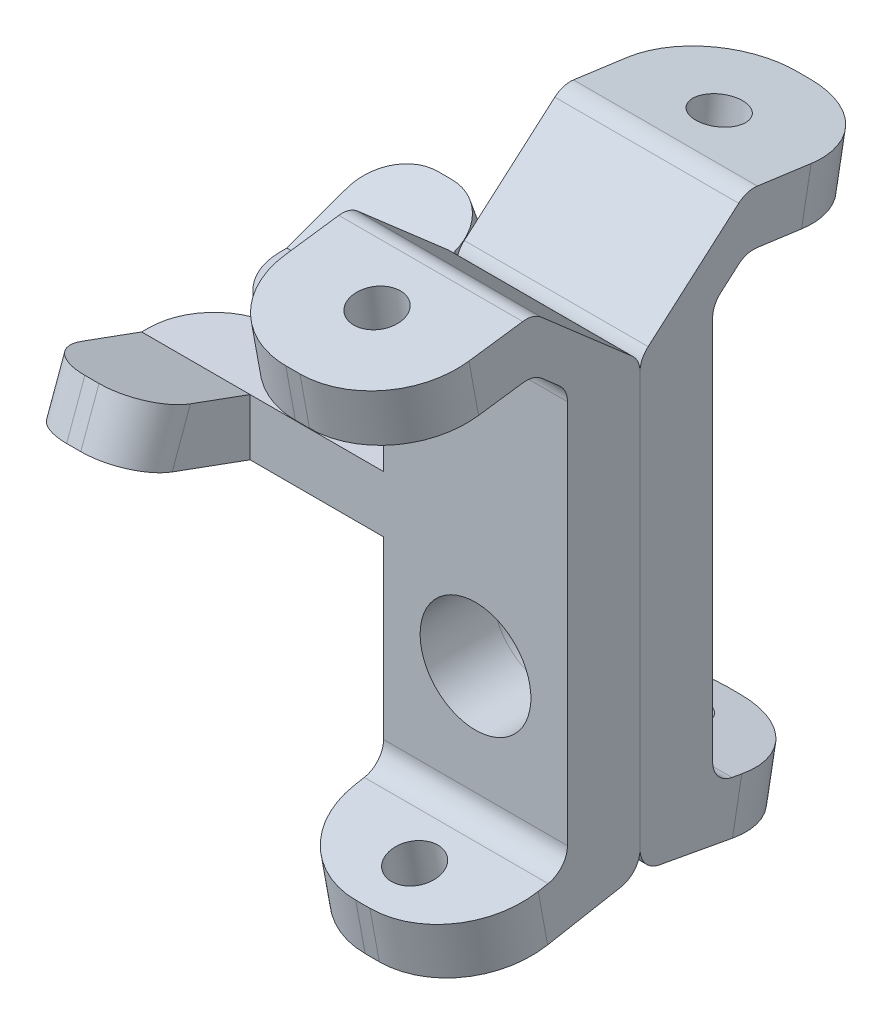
ISO-10303-21;
HEADER;
FILE_DESCRIPTION(('STEP AP214'),'2;1');
FILE_NAME('part.step','',(''),(''),'','','');
FILE_SCHEMA(('AUTOMOTIVE_DESIGN { 1 0 10303 214 1 1 1 1 }'));
ENDSEC;
DATA;
#1=APPLICATION_CONTEXT('core data for automotive mechanical design processes');
#2=APPLICATION_PROTOCOL_DEFINITION('international standard','automotive_design',2000,#1);
#3=PRODUCT_CONTEXT('',#1,'mechanical');
#4=PRODUCT('Part','Part','',(#3));
#5=PRODUCT_RELATED_PRODUCT_CATEGORY('part','',(#4));
#6=PRODUCT_DEFINITION_FORMATION('','',#4);
#7=PRODUCT_DEFINITION_CONTEXT('part definition',#1,'design');
#8=PRODUCT_DEFINITION('design','',#6,#7);
#9=PRODUCT_DEFINITION_SHAPE('','',#8);
#10=(LENGTH_UNIT() NAMED_UNIT(*) SI_UNIT(.MILLI.,.METRE.));
#11=(NAMED_UNIT(*) PLANE_ANGLE_UNIT() SI_UNIT($,.RADIAN.));
#12=(NAMED_UNIT(*) SI_UNIT($,.STERADIAN.) SOLID_ANGLE_UNIT());
#13=UNCERTAINTY_MEASURE_WITH_UNIT(LENGTH_MEASURE(1.E-05),#10,'distance_accuracy_value','');
#14=(GEOMETRIC_REPRESENTATION_CONTEXT(3) GLOBAL_UNCERTAINTY_ASSIGNED_CONTEXT((#13)) GLOBAL_UNIT_ASSIGNED_CONTEXT((#10,
#11,#12)) REPRESENTATION_CONTEXT('',''));
#15=CARTESIAN_POINT('',(0.,0.,0.));
#16=DIRECTION('',(0.,0.,1.));
#17=DIRECTION('',(1.,0.,0.));
#18=AXIS2_PLACEMENT_3D('',#15,#16,#17);
#19=CARTESIAN_POINT('',(-24.76754,83.0072,0.));
#20=DIRECTION('',(-1.,0.,0.));
#21=DIRECTION('',(0.,0.,-1.));
#22=AXIS2_PLACEMENT_3D('',#19,#20,#21);
#23=PLANE('',#22);
#24=DIRECTION('',(0.,-0.18052784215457,-0.983569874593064));
#25=VECTOR('',#24,1.);
#26=CARTESIAN_POINT('',(-24.76754,-45.4152,0.));
#27=LINE('',#26,#25);
#28=CARTESIAN_POINT('',(-24.76754,-46.370295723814,-5.20364820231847));
#29=VERTEX_POINT('',#28);
#30=CARTESIAN_POINT('',(-24.76754,-49.9849511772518,-24.8973761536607));
#31=VERTEX_POINT('',#30);
#32=EDGE_CURVE('E320',#29,#31,#27,.T.);
#33=ORIENTED_EDGE('',*,*,#32,.F.);
#34=CARTESIAN_POINT('',(-24.76754,-40.124627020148,-6.35));
#35=DIRECTION('',(1.,0.,0.));
#36=DIRECTION('',(0.,0.,-1.));
#37=AXIS2_PLACEMENT_3D('',#34,#35,#36);
#38=CIRCLE('',#37,6.35);
#39=CARTESIAN_POINT('',(-24.76754,-40.124627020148,0.));
#40=VERTEX_POINT('',#39);
#41=EDGE_CURVE('E627',#40,#29,#38,.T.);
#42=ORIENTED_EDGE('',*,*,#41,.F.);
#43=DIRECTION('',(0.,-1.,0.));
#44=VECTOR('',#43,1.);
#45=CARTESIAN_POINT('',(-24.76754,83.0072,0.));
#46=LINE('',#45,#44);
#47=CARTESIAN_POINT('',(-24.76754,17.78,0.));
#48=VERTEX_POINT('',#47);
#49=EDGE_CURVE('E546',#48,#40,#46,.T.);
#50=ORIENTED_EDGE('',*,*,#49,.F.);
#51=DIRECTION('',(0.,0.,1.));
#52=VECTOR('',#51,1.);
#53=CARTESIAN_POINT('',(-24.76754,17.78,0.));
#54=LINE('',#53,#52);
#55=CARTESIAN_POINT('',(-24.76754,17.78,-19.558));
#56=VERTEX_POINT('',#55);
#57=EDGE_CURVE('E379',#56,#48,#54,.T.);
#58=ORIENTED_EDGE('',*,*,#57,.F.);
#59=DIRECTION('',(0.,-1.,0.));
#60=VECTOR('',#59,1.);
#61=CARTESIAN_POINT('',(-24.76754,83.0072,-19.558));
#62=LINE('',#61,#60);
#63=CARTESIAN_POINT('',(-24.76754,-29.4903704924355,-19.558));
#64=VERTEX_POINT('',#63);
#65=EDGE_CURVE('E512',#56,#64,#62,.T.);
#66=ORIENTED_EDGE('',*,*,#65,.T.);
#67=CARTESIAN_POINT('',(-24.76754,-29.4903704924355,-25.908));
#68=DIRECTION('',(1.,0.,0.));
#69=DIRECTION('',(0.,0.,-1.));
#70=AXIS2_PLACEMENT_3D('',#67,#68,#69);
#71=CIRCLE('',#70,6.35);
#72=CARTESIAN_POINT('',(-24.76754,-35.7360391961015,-24.7616482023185));
#73=VERTEX_POINT('',#72);
#74=EDGE_CURVE('E664',#73,#64,#71,.F.);
#75=ORIENTED_EDGE('',*,*,#74,.F.);
#76=DIRECTION('',(0.,-0.18052784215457,-0.983569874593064));
#77=VECTOR('',#76,1.);
#78=CARTESIAN_POINT('',(-24.76754,-31.1912,0.));
#79=LINE('',#78,#77);
#80=CARTESIAN_POINT('',(-24.76754,-36.2245156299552,-27.4230144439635));
#81=VERTEX_POINT('',#80);
#82=EDGE_CURVE('E495',#73,#81,#79,.T.);
#83=ORIENTED_EDGE('',*,*,#82,.T.);
#84=DIRECTION('',(0.,0.983569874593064,-0.18052784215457));
#85=VECTOR('',#84,1.);
#86=CARTESIAN_POINT('',(-24.76754,-36.2245156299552,-27.4230144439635));
#87=LINE('',#86,#85);
#88=EDGE_CURVE('E289',#31,#81,#87,.T.);
#89=ORIENTED_EDGE('',*,*,#88,.F.);
#90=EDGE_LOOP('',(#33,#42,#50,#58,#66,#75,#83,#89));
#91=FACE_BOUND('',#90,.T.);
#92=ADVANCED_FACE('F46',(#91),#23,.T.);
#93=CARTESIAN_POINT('',(-24.76754,71.2779299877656,0.));
#94=VERTEX_POINT('',#93);
#95=CARTESIAN_POINT('',(-24.76754,33.02,0.));
#96=VERTEX_POINT('',#95);
#97=EDGE_CURVE('E543',#94,#96,#46,.T.);
#98=ORIENTED_EDGE('',*,*,#97,.F.);
#99=CARTESIAN_POINT('',(-24.76754,71.2779299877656,-6.35));
#100=DIRECTION('',(1.,0.,0.));
#101=DIRECTION('',(0.,0.,-1.));
#102=AXIS2_PLACEMENT_3D('',#99,#100,#101);
#103=CIRCLE('',#102,6.35);
#104=CARTESIAN_POINT('',(-24.76754,76.06621296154,-2.17928709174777));
#105=VERTEX_POINT('',#104);
#106=EDGE_CURVE('E1034',#105,#94,#103,.T.);
#107=ORIENTED_EDGE('',*,*,#106,.F.);
#108=DIRECTION('',(0.,-0.656805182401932,0.754060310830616));
#109=VECTOR('',#108,1.);
#110=CARTESIAN_POINT('',(-24.76754,99.2124,-28.7528));
#111=LINE('',#110,#109);
#112=CARTESIAN_POINT('',(-24.76754,97.319166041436,-26.579229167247));
#113=VERTEX_POINT('',#112);
#114=EDGE_CURVE('E583',#113,#105,#111,.T.);
#115=ORIENTED_EDGE('',*,*,#114,.F.);
#116=CARTESIAN_POINT('',(-24.76754,92.5308830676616,-30.7499420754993));
#117=DIRECTION('',(1.,0.,0.));
#118=DIRECTION('',(0.,0.,-1.));
#119=AXIS2_PLACEMENT_3D('',#116,#117,#118);
#120=CIRCLE('',#119,6.35);
#121=CARTESIAN_POINT('',(-24.76754,98.8225330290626,-31.6088022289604));
#122=VERTEX_POINT('',#121);
#123=EDGE_CURVE('E587',#122,#113,#120,.T.);
#124=ORIENTED_EDGE('',*,*,#123,.F.);
#125=DIRECTION('',(0.,-0.135253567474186,-0.990811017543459));
#126=VECTOR('',#125,1.);
#127=CARTESIAN_POINT('',(-24.76754,99.2124,-28.7528));
#128=LINE('',#127,#126);
#129=CARTESIAN_POINT('',(-24.76754,96.8465498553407,-46.0840278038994));
#130=VERTEX_POINT('',#129);
#131=EDGE_CURVE('E573',#122,#130,#128,.T.);
#132=ORIENTED_EDGE('',*,*,#131,.T.);
#133=DIRECTION('',(0.,-0.983569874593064,0.18052784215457));
#134=VECTOR('',#133,1.);
#135=CARTESIAN_POINT('',(-24.76754,97.8782664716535,-46.2733926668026));
#136=LINE('',#135,#134);
#137=CARTESIAN_POINT('',(-24.76754,82.856251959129,-43.5161997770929));
#138=VERTEX_POINT('',#137);
#139=EDGE_CURVE('E551',#138,#130,#136,.F.);
#140=ORIENTED_EDGE('',*,*,#139,.F.);
#141=DIRECTION('',(0.,-0.135253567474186,-0.990811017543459));
#142=VECTOR('',#141,1.);
#143=CARTESIAN_POINT('',(-24.76754,85.2221021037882,-26.1849719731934));
#144=LINE('',#143,#142);
#145=CARTESIAN_POINT('',(-24.76754,84.4975347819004,-31.4928488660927));
#146=VERTEX_POINT('',#145);
#147=EDGE_CURVE('E288',#146,#138,#144,.T.);
#148=ORIENTED_EDGE('',*,*,#147,.F.);
#149=CARTESIAN_POINT('',(-24.76754,78.2058848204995,-30.6339887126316));
#150=DIRECTION('',(1.,0.,0.));
#151=DIRECTION('',(0.,0.,-1.));
#152=AXIS2_PLACEMENT_3D('',#149,#150,#151);
#153=CIRCLE('',#152,6.35);
#154=CARTESIAN_POINT('',(-24.76754,82.9941677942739,-26.4632758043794));
#155=VERTEX_POINT('',#154);
#156=EDGE_CURVE('E578',#155,#146,#153,.F.);
#157=ORIENTED_EDGE('',*,*,#156,.F.);
#158=DIRECTION('',(0.,-0.656805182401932,0.754060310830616));
#159=VECTOR('',#158,1.);
#160=CARTESIAN_POINT('',(-24.76754,84.9884,-28.7528));
#161=LINE('',#160,#159);
#162=CARTESIAN_POINT('',(-24.76754,78.8777147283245,-21.7372870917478));
#163=VERTEX_POINT('',#162);
#164=EDGE_CURVE('E590',#155,#163,#161,.T.);
#165=ORIENTED_EDGE('',*,*,#164,.T.);
#166=CARTESIAN_POINT('',(-24.76754,74.0894317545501,-25.908));
#167=DIRECTION('',(1.,0.,0.));
#168=DIRECTION('',(0.,0.,-1.));
#169=AXIS2_PLACEMENT_3D('',#166,#167,#168);
#170=CIRCLE('',#169,6.35);
#171=CARTESIAN_POINT('',(-24.76754,74.0894317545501,-19.558));
#172=VERTEX_POINT('',#171);
#173=EDGE_CURVE('E504',#172,#163,#170,.F.);
#174=ORIENTED_EDGE('',*,*,#173,.F.);
#175=CARTESIAN_POINT('',(-24.76754,33.02,-19.558));
#176=VERTEX_POINT('',#175);
#177=EDGE_CURVE('E550',#172,#176,#62,.T.);
#178=ORIENTED_EDGE('',*,*,#177,.T.);
#179=DIRECTION('',(0.,0.,-1.));
#180=VECTOR('',#179,1.);
#181=CARTESIAN_POINT('',(-24.76754,33.02,0.));
#182=LINE('',#181,#180);
#183=EDGE_CURVE('E555',#96,#176,#182,.T.);
#184=ORIENTED_EDGE('',*,*,#183,.F.);
#185=EDGE_LOOP('',(#98,#107,#115,#124,#132,#140,#148,#157,#165,#174,#178,#184));
#186=FACE_BOUND('',#185,.T.);
#187=ADVANCED_FACE('F419',(#186),#23,.T.);
#188=CARTESIAN_POINT('',(0.,34.0845751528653,29.6885080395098));
#189=DIRECTION('',(0.,0.754060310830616,0.656805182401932));
#190=DIRECTION('',(0.,0.656805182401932,-0.754060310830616));
#191=AXIS2_PLACEMENT_3D('',#188,#189,#190);
#192=PLANE('',#191);
#193=DIRECTION('',(0.,-0.656805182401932,0.754060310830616));
#194=VECTOR('',#193,1.);
#195=CARTESIAN_POINT('',(24.76754,84.9884,-28.7528));
#196=LINE('',#195,#194);
#197=CARTESIAN_POINT('',(24.76754,82.9941677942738,-26.4632758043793));
#198=VERTEX_POINT('',#197);
#199=CARTESIAN_POINT('',(24.76754,78.8777147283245,-21.7372870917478));
#200=VERTEX_POINT('',#199);
#201=EDGE_CURVE('E500',#198,#200,#196,.T.);
#202=ORIENTED_EDGE('',*,*,#201,.T.);
#203=DIRECTION('',(1.,0.,0.));
#204=VECTOR('',#203,1.);
#205=CARTESIAN_POINT('',(24.76754,78.8777147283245,-21.7372870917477));
#206=LINE('',#205,#204);
#207=EDGE_CURVE('E1008',#163,#200,#206,.T.);
#208=ORIENTED_EDGE('',*,*,#207,.F.);
#209=ORIENTED_EDGE('',*,*,#164,.F.);
#210=DIRECTION('',(1.,0.,0.));
#211=VECTOR('',#210,1.);
#212=CARTESIAN_POINT('',(-24.76754,82.9941677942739,-26.4632758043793));
#213=LINE('',#212,#211);
#214=EDGE_CURVE('E610',#198,#155,#213,.F.);
#215=ORIENTED_EDGE('',*,*,#214,.F.);
#216=EDGE_LOOP('',(#202,#208,#209,#215));
#217=FACE_BOUND('',#216,.T.);
#218=ADVANCED_FACE('F425',(#217),#192,.F.);
#219=CARTESIAN_POINT('',(0.,0.,-19.558));
#220=DIRECTION('',(0.,0.,1.));
#221=DIRECTION('',(-1.,0.,0.));
#222=AXIS2_PLACEMENT_3D('',#219,#220,#221);
#223=PLANE('',#222);
#224=DIRECTION('',(1.,0.,0.));
#225=VECTOR('',#224,1.);
#226=CARTESIAN_POINT('',(-89.9414,33.02,-19.558));
#227=LINE('',#226,#225);
#228=CARTESIAN_POINT('',(-60.7314,33.02,-19.558));
#229=VERTEX_POINT('',#228);
#230=EDGE_CURVE('E250',#229,#176,#227,.T.);
#231=ORIENTED_EDGE('',*,*,#230,.T.);
#232=ORIENTED_EDGE('',*,*,#177,.F.);
#233=DIRECTION('',(1.,0.,0.));
#234=VECTOR('',#233,1.);
#235=CARTESIAN_POINT('',(-24.76754,74.0894317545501,-19.558));
#236=LINE('',#235,#234);
#237=CARTESIAN_POINT('',(24.76754,74.0894317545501,-19.558));
#238=VERTEX_POINT('',#237);
#239=EDGE_CURVE('E680',#238,#172,#236,.F.);
#240=ORIENTED_EDGE('',*,*,#239,.F.);
#241=DIRECTION('',(0.,1.,0.));
#242=VECTOR('',#241,1.);
#243=CARTESIAN_POINT('',(24.76754,83.0072,-19.558));
#244=LINE('',#243,#242);
#245=CARTESIAN_POINT('',(24.76754,-29.4903704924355,-19.558));
#246=VERTEX_POINT('',#245);
#247=EDGE_CURVE('E513',#246,#238,#244,.T.);
#248=ORIENTED_EDGE('',*,*,#247,.F.);
#249=DIRECTION('',(1.,0.,0.));
#250=VECTOR('',#249,1.);
#251=CARTESIAN_POINT('',(0.,-29.4903704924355,-19.558));
#252=LINE('',#251,#250);
#253=EDGE_CURVE('E531',#64,#246,#252,.T.);
#254=ORIENTED_EDGE('',*,*,#253,.F.);
#255=ORIENTED_EDGE('',*,*,#65,.F.);
#256=DIRECTION('',(-1.,0.,0.));
#257=VECTOR('',#256,1.);
#258=CARTESIAN_POINT('',(0.,17.78,-19.558));
#259=LINE('',#258,#257);
#260=CARTESIAN_POINT('',(-60.7314,17.78,-19.558));
#261=VERTEX_POINT('',#260);
#262=EDGE_CURVE('E269',#56,#261,#259,.T.);
#263=ORIENTED_EDGE('',*,*,#262,.T.);
#264=DIRECTION('',(0.,1.,0.));
#265=VECTOR('',#264,1.);
#266=CARTESIAN_POINT('',(-60.7314,33.02,-19.558));
#267=LINE('',#266,#265);
#268=EDGE_CURVE('E339',#261,#229,#267,.T.);
#269=ORIENTED_EDGE('',*,*,#268,.T.);
#270=EDGE_LOOP('',(#231,#232,#240,#248,#254,#255,#263,#269));
#271=FACE_BOUND('',#270,.T.);
#272=CARTESIAN_POINT('',(0.,0.,-19.558));
#273=DIRECTION('',(0.,0.,-1.));
#274=DIRECTION('',(-1.,0.,0.));
#275=AXIS2_PLACEMENT_3D('',#272,#273,#274);
#276=CIRCLE('',#275,14.9225);
#277=CARTESIAN_POINT('',(-14.9225,0.,-19.558));
#278=VERTEX_POINT('',#277);
#279=EDGE_CURVE('E528',#278,#278,#276,.F.);
#280=ORIENTED_EDGE('',*,*,#279,.T.);
#281=EDGE_LOOP('',(#280));
#282=FACE_BOUND('',#281,.T.);
#283=ADVANCED_FACE('F435',(#271,#282),#223,.F.);
#284=CARTESIAN_POINT('',(0.,0.,0.));
#285=DIRECTION('',(0.,0.,1.));
#286=DIRECTION('',(-1.,0.,0.));
#287=AXIS2_PLACEMENT_3D('',#284,#285,#286);
#288=PLANE('',#287);
#289=DIRECTION('',(-1.,0.,0.));
#290=VECTOR('',#289,1.);
#291=CARTESIAN_POINT('',(0.,17.78,0.));
#292=LINE('',#291,#290);
#293=CARTESIAN_POINT('',(-72.1614,17.78,0.));
#294=VERTEX_POINT('',#293);
#295=EDGE_CURVE('E272',#48,#294,#292,.T.);
#296=ORIENTED_EDGE('',*,*,#295,.F.);
#297=ORIENTED_EDGE('',*,*,#49,.T.);
#298=DIRECTION('',(1.,0.,0.));
#299=VECTOR('',#298,1.);
#300=CARTESIAN_POINT('',(-24.76754,-40.124627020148,0.));
#301=LINE('',#300,#299);
#302=CARTESIAN_POINT('',(24.76754,-40.124627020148,0.));
#303=VERTEX_POINT('',#302);
#304=EDGE_CURVE('E1013',#303,#40,#301,.F.);
#305=ORIENTED_EDGE('',*,*,#304,.F.);
#306=DIRECTION('',(0.,1.,0.));
#307=VECTOR('',#306,1.);
#308=CARTESIAN_POINT('',(24.76754,83.0072,0.));
#309=LINE('',#308,#307);
#310=CARTESIAN_POINT('',(24.76754,71.2779299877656,0.));
#311=VERTEX_POINT('',#310);
#312=EDGE_CURVE('E508',#303,#311,#309,.T.);
#313=ORIENTED_EDGE('',*,*,#312,.T.);
#314=DIRECTION('',(-1.,0.,0.));
#315=VECTOR('',#314,1.);
#316=CARTESIAN_POINT('',(0.,71.2779299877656,0.));
#317=LINE('',#316,#315);
#318=EDGE_CURVE('E1033',#94,#311,#317,.F.);
#319=ORIENTED_EDGE('',*,*,#318,.F.);
#320=ORIENTED_EDGE('',*,*,#97,.T.);
#321=DIRECTION('',(1.,0.,0.));
#322=VECTOR('',#321,1.);
#323=CARTESIAN_POINT('',(-89.9414,33.02,0.));
#324=LINE('',#323,#322);
#325=CARTESIAN_POINT('',(-72.1614,33.02,0.));
#326=VERTEX_POINT('',#325);
#327=EDGE_CURVE('E254',#326,#96,#324,.T.);
#328=ORIENTED_EDGE('',*,*,#327,.F.);
#329=DIRECTION('',(0.,1.,0.));
#330=VECTOR('',#329,1.);
#331=CARTESIAN_POINT('',(-72.1614,33.02,0.));
#332=LINE('',#331,#330);
#333=EDGE_CURVE('E278',#294,#326,#332,.T.);
#334=ORIENTED_EDGE('',*,*,#333,.F.);
#335=EDGE_LOOP('',(#296,#297,#305,#313,#319,#320,#328,#334));
#336=FACE_BOUND('',#335,.T.);
#337=CARTESIAN_POINT('',(0.,0.,0.));
#338=DIRECTION('',(0.,0.,1.));
#339=DIRECTION('',(1.,0.,0.));
#340=AXIS2_PLACEMENT_3D('',#337,#338,#339);
#341=CIRCLE('',#340,14.9225);
#342=CARTESIAN_POINT('',(14.9225,0.,0.));
#343=VERTEX_POINT('',#342);
#344=EDGE_CURVE('E305',#343,#343,#341,.T.);
#345=ORIENTED_EDGE('',*,*,#344,.F.);
#346=EDGE_LOOP('',(#345));
#347=FACE_BOUND('',#346,.T.);
#348=ADVANCED_FACE('F432',(#336,#347),#288,.T.);
#349=CARTESIAN_POINT('',(24.76754,83.0072,0.));
#350=DIRECTION('',(1.,0.,0.));
#351=DIRECTION('',(0.,0.,1.));
#352=AXIS2_PLACEMENT_3D('',#349,#350,#351);
#353=PLANE('',#352);
#354=DIRECTION('',(0.,0.18052784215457,0.983569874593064));
#355=VECTOR('',#354,1.);
#356=CARTESIAN_POINT('',(24.76754,-39.1175414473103,-43.1850875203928));
#357=LINE('',#356,#355);
#358=CARTESIAN_POINT('',(24.76754,-36.2245156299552,-27.4230144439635));
#359=VERTEX_POINT('',#358);
#360=CARTESIAN_POINT('',(24.76754,-35.7360391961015,-24.7616482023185));
#361=VERTEX_POINT('',#360);
#362=EDGE_CURVE('E306',#359,#361,#357,.T.);
#363=ORIENTED_EDGE('',*,*,#362,.T.);
#364=CARTESIAN_POINT('',(24.76754,-29.4903704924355,-25.908));
#365=DIRECTION('',(-1.,0.,0.));
#366=DIRECTION('',(0.,0.,1.));
#367=AXIS2_PLACEMENT_3D('',#364,#365,#366);
#368=CIRCLE('',#367,6.35);
#369=EDGE_CURVE('E668',#246,#361,#368,.F.);
#370=ORIENTED_EDGE('',*,*,#369,.F.);
#371=ORIENTED_EDGE('',*,*,#247,.T.);
#372=CARTESIAN_POINT('',(24.76754,74.0894317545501,-25.908));
#373=DIRECTION('',(-1.,0.,0.));
#374=DIRECTION('',(0.,0.,1.));
#375=AXIS2_PLACEMENT_3D('',#372,#373,#374);
#376=CIRCLE('',#375,6.35);
#377=EDGE_CURVE('E683',#200,#238,#376,.F.);
#378=ORIENTED_EDGE('',*,*,#377,.F.);
#379=ORIENTED_EDGE('',*,*,#201,.F.);
#380=CARTESIAN_POINT('',(24.76754,78.2058848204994,-30.6339887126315));
#381=DIRECTION('',(-1.,0.,0.));
#382=DIRECTION('',(0.,0.,1.));
#383=AXIS2_PLACEMENT_3D('',#380,#381,#382);
#384=CIRCLE('',#383,6.35);
#385=CARTESIAN_POINT('',(24.76754,84.4975347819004,-31.4928488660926));
#386=VERTEX_POINT('',#385);
#387=EDGE_CURVE('E611',#386,#198,#384,.F.);
#388=ORIENTED_EDGE('',*,*,#387,.F.);
#389=DIRECTION('',(0.,-0.135253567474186,-0.99081101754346));
#390=VECTOR('',#389,1.);
#391=CARTESIAN_POINT('',(24.76754,85.2221021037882,-26.1849719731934));
#392=LINE('',#391,#390);
#393=CARTESIAN_POINT('',(24.76754,82.856251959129,-43.5161997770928));
#394=VERTEX_POINT('',#393);
#395=EDGE_CURVE('E584',#386,#394,#392,.T.);
#396=ORIENTED_EDGE('',*,*,#395,.T.);
#397=DIRECTION('',(0.,-0.983569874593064,0.18052784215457));
#398=VECTOR('',#397,1.);
#399=CARTESIAN_POINT('',(24.76754,83.8879685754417,-43.705564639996));
#400=LINE('',#399,#398);
#401=CARTESIAN_POINT('',(24.76754,96.8465498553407,-46.0840278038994));
#402=VERTEX_POINT('',#401);
#403=EDGE_CURVE('E663',#402,#394,#400,.T.);
#404=ORIENTED_EDGE('',*,*,#403,.F.);
#405=DIRECTION('',(0.,-0.135253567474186,-0.99081101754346));
#406=VECTOR('',#405,1.);
#407=CARTESIAN_POINT('',(24.76754,99.2124,-28.7528));
#408=LINE('',#407,#406);
#409=CARTESIAN_POINT('',(24.76754,98.8225330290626,-31.6088022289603));
#410=VERTEX_POINT('',#409);
#411=EDGE_CURVE('E580',#410,#402,#408,.T.);
#412=ORIENTED_EDGE('',*,*,#411,.F.);
#413=CARTESIAN_POINT('',(24.76754,92.5308830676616,-30.7499420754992));
#414=DIRECTION('',(-1.,0.,0.));
#415=DIRECTION('',(0.,0.,1.));
#416=AXIS2_PLACEMENT_3D('',#413,#414,#415);
#417=CIRCLE('',#416,6.35);
#418=CARTESIAN_POINT('',(24.76754,97.319166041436,-26.579229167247));
#419=VERTEX_POINT('',#418);
#420=EDGE_CURVE('E529',#419,#410,#417,.T.);
#421=ORIENTED_EDGE('',*,*,#420,.F.);
#422=DIRECTION('',(0.,-0.656805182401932,0.754060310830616));
#423=VECTOR('',#422,1.);
#424=CARTESIAN_POINT('',(24.76754,99.2124,-28.7528));
#425=LINE('',#424,#423);
#426=CARTESIAN_POINT('',(24.76754,76.06621296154,-2.17928709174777));
#427=VERTEX_POINT('',#426);
#428=EDGE_CURVE('E594',#419,#427,#425,.T.);
#429=ORIENTED_EDGE('',*,*,#428,.T.);
#430=CARTESIAN_POINT('',(24.76754,71.2779299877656,-6.35));
#431=DIRECTION('',(-1.,0.,0.));
#432=DIRECTION('',(0.,0.,1.));
#433=AXIS2_PLACEMENT_3D('',#430,#431,#432);
#434=CIRCLE('',#433,6.35);
#435=EDGE_CURVE('E1018',#311,#427,#434,.T.);
#436=ORIENTED_EDGE('',*,*,#435,.F.);
#437=ORIENTED_EDGE('',*,*,#312,.F.);
#438=CARTESIAN_POINT('',(24.76754,-40.124627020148,-6.35));
#439=DIRECTION('',(-1.,0.,0.));
#440=DIRECTION('',(0.,0.,1.));
#441=AXIS2_PLACEMENT_3D('',#438,#439,#440);
#442=CIRCLE('',#441,6.35);
#443=CARTESIAN_POINT('',(24.76754,-46.370295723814,-5.20364820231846));
#444=VERTEX_POINT('',#443);
#445=EDGE_CURVE('E507',#444,#303,#442,.T.);
#446=ORIENTED_EDGE('',*,*,#445,.F.);
#447=DIRECTION('',(0.,0.18052784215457,0.983569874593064));
#448=VECTOR('',#447,1.);
#449=CARTESIAN_POINT('',(24.76754,-53.3415414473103,-43.1850875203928));
#450=LINE('',#449,#448);
#451=CARTESIAN_POINT('',(24.76754,-49.9849511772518,-24.8973761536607));
#452=VERTEX_POINT('',#451);
#453=EDGE_CURVE('E301',#452,#444,#450,.T.);
#454=ORIENTED_EDGE('',*,*,#453,.F.);
#455=DIRECTION('',(0.,0.983569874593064,-0.18052784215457));
#456=VECTOR('',#455,1.);
#457=CARTESIAN_POINT('',(24.76754,-49.9849511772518,-24.8973761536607));
#458=LINE('',#457,#456);
#459=EDGE_CURVE('E297',#359,#452,#458,.F.);
#460=ORIENTED_EDGE('',*,*,#459,.F.);
#461=EDGE_LOOP('',(#363,#370,#371,#378,#379,#388,#396,#404,#412,#421,#429,#436,#437,#446,#454,#460));
#462=FACE_BOUND('',#461,.T.);
#463=ADVANCED_FACE('F430',(#462),#353,.T.);
#464=CARTESIAN_POINT('',(0.,0.,-19.5581030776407));
#465=DIRECTION('',(0.,0.,1.));
#466=DIRECTION('',(-1.,0.,0.));
#467=AXIS2_PLACEMENT_3D('',#464,#465,#466);
#468=CYLINDRICAL_SURFACE('',#467,14.9225);
#469=ORIENTED_EDGE('',*,*,#344,.T.);
#470=EDGE_LOOP('',(#469));
#471=FACE_BOUND('',#470,.T.);
#472=ORIENTED_EDGE('',*,*,#279,.F.);
#473=EDGE_LOOP('',(#472));
#474=FACE_BOUND('',#473,.T.);
#475=ADVANCED_FACE('F717',(#471,#474),#468,.F.);
#476=CARTESIAN_POINT('',(0.,-29.7111049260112,8.06400225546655));
#477=DIRECTION('',(0.,0.983569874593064,-0.18052784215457));
#478=DIRECTION('',(0.,-0.18052784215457,-0.983569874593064));
#479=AXIS2_PLACEMENT_3D('',#476,#477,#478);
#480=PLANE('',#479);
#481=CARTESIAN_POINT('',(0.,-37.7897743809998,-35.9510139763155));
#482=DIRECTION('',(0.,-0.983569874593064,0.18052784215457));
#483=DIRECTION('',(0.,-0.18052784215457,-0.983569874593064));
#484=AXIS2_PLACEMENT_3D('',#481,#482,#483);
#485=CIRCLE('',#484,6.35);
#486=CARTESIAN_POINT('',(0.,-38.9361261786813,-42.1966826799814));
#487=VERTEX_POINT('',#486);
#488=EDGE_CURVE('E697',#487,#487,#485,.T.);
#489=ORIENTED_EDGE('',*,*,#488,.T.);
#490=EDGE_LOOP('',(#489));
#491=FACE_BOUND('',#490,.T.);
#492=DIRECTION('',(1.,0.,0.));
#493=VECTOR('',#492,1.);
#494=CARTESIAN_POINT('',(-24.76754,-40.3513821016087,-49.9074217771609));
#495=LINE('',#494,#493);
#496=CARTESIAN_POINT('',(-1.90754000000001,-40.3513821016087,-49.9074217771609));
#497=VERTEX_POINT('',#496);
#498=CARTESIAN_POINT('',(1.90753999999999,-40.3513821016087,-49.9074217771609));
#499=VERTEX_POINT('',#498);
#500=EDGE_CURVE('E340',#497,#499,#495,.T.);
#501=ORIENTED_EDGE('',*,*,#500,.F.);
#502=CARTESIAN_POINT('',(-1.90754000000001,-36.2245156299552,-27.4230144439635));
#503=DIRECTION('',(0.,-0.983569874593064,0.18052784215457));
#504=DIRECTION('',(0.,-0.18052784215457,-0.983569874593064));
#505=AXIS2_PLACEMENT_3D('',#502,#503,#504);
#506=CIRCLE('',#505,22.86);
#507=EDGE_CURVE('E323',#81,#497,#506,.T.);
#508=ORIENTED_EDGE('',*,*,#507,.F.);
#509=ORIENTED_EDGE('',*,*,#82,.F.);
#510=DIRECTION('',(1.,0.,0.));
#511=VECTOR('',#510,1.);
#512=CARTESIAN_POINT('',(0.,-35.7360391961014,-24.7616482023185));
#513=LINE('',#512,#511);
#514=EDGE_CURVE('E533',#361,#73,#513,.F.);
#515=ORIENTED_EDGE('',*,*,#514,.F.);
#516=ORIENTED_EDGE('',*,*,#362,.F.);
#517=CARTESIAN_POINT('',(1.90753999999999,-36.2245156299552,-27.4230144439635));
#518=DIRECTION('',(0.,-0.983569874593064,0.18052784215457));
#519=DIRECTION('',(0.,-0.18052784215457,-0.983569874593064));
#520=AXIS2_PLACEMENT_3D('',#517,#518,#519);
#521=CIRCLE('',#520,22.86);
#522=EDGE_CURVE('E300',#499,#359,#521,.T.);
#523=ORIENTED_EDGE('',*,*,#522,.F.);
#524=EDGE_LOOP('',(#501,#508,#509,#515,#516,#523));
#525=FACE_BOUND('',#524,.T.);
#526=ADVANCED_FACE('F672',(#491,#525),#480,.T.);
#527=CARTESIAN_POINT('',(0.,-43.9351049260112,8.06400225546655));
#528=DIRECTION('',(0.,0.983569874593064,-0.18052784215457));
#529=DIRECTION('',(0.,-0.18052784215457,-0.983569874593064));
#530=AXIS2_PLACEMENT_3D('',#527,#528,#529);
#531=PLANE('',#530);
#532=CARTESIAN_POINT('',(0.,-51.5502099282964,-33.4253756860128));
#533=DIRECTION('',(0.,-0.983569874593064,0.18052784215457));
#534=DIRECTION('',(0.,-0.18052784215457,-0.983569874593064));
#535=AXIS2_PLACEMENT_3D('',#532,#533,#534);
#536=CIRCLE('',#535,6.35);
#537=CARTESIAN_POINT('',(0.,-52.6965617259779,-39.6710443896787));
#538=VERTEX_POINT('',#537);
#539=EDGE_CURVE('E50',#538,#538,#536,.T.);
#540=ORIENTED_EDGE('',*,*,#539,.F.);
#541=EDGE_LOOP('',(#540));
#542=FACE_BOUND('',#541,.T.);
#543=ORIENTED_EDGE('',*,*,#453,.T.);
#544=DIRECTION('',(1.,0.,0.));
#545=VECTOR('',#544,1.);
#546=CARTESIAN_POINT('',(24.76754,-46.3702957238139,-5.20364820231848));
#547=LINE('',#546,#545);
#548=EDGE_CURVE('E497',#29,#444,#547,.T.);
#549=ORIENTED_EDGE('',*,*,#548,.F.);
#550=ORIENTED_EDGE('',*,*,#32,.T.);
#551=CARTESIAN_POINT('',(-1.90754000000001,-49.9849511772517,-24.8973761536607));
#552=DIRECTION('',(0.,-0.983569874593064,0.18052784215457));
#553=DIRECTION('',(0.,-0.18052784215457,-0.983569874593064));
#554=AXIS2_PLACEMENT_3D('',#551,#552,#553);
#555=CIRCLE('',#554,22.86);
#556=CARTESIAN_POINT('',(-1.90754000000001,-54.1118176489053,-47.3817834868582));
#557=VERTEX_POINT('',#556);
#558=EDGE_CURVE('E295',#557,#31,#555,.F.);
#559=ORIENTED_EDGE('',*,*,#558,.F.);
#560=DIRECTION('',(1.,0.,0.));
#561=VECTOR('',#560,1.);
#562=CARTESIAN_POINT('',(-24.76754,-54.1118176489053,-47.3817834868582));
#563=LINE('',#562,#561);
#564=CARTESIAN_POINT('',(1.90753999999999,-54.1118176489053,-47.3817834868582));
#565=VERTEX_POINT('',#564);
#566=EDGE_CURVE('E335',#557,#565,#563,.T.);
#567=ORIENTED_EDGE('',*,*,#566,.T.);
#568=CARTESIAN_POINT('',(1.90753999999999,-49.9849511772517,-24.8973761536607));
#569=DIRECTION('',(0.,-0.983569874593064,0.18052784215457));
#570=DIRECTION('',(0.,-0.18052784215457,-0.983569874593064));
#571=AXIS2_PLACEMENT_3D('',#568,#569,#570);
#572=CIRCLE('',#571,22.86);
#573=EDGE_CURVE('E292',#452,#565,#572,.F.);
#574=ORIENTED_EDGE('',*,*,#573,.F.);
#575=EDGE_LOOP('',(#543,#549,#550,#559,#567,#574));
#576=FACE_BOUND('',#575,.T.);
#577=ADVANCED_FACE('F496',(#542,#576),#531,.F.);
#578=CARTESIAN_POINT('',(0.,48.3085751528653,29.6885080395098));
#579=DIRECTION('',(0.,0.754060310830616,0.656805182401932));
#580=DIRECTION('',(0.,0.656805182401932,-0.754060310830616));
#581=AXIS2_PLACEMENT_3D('',#578,#579,#580);
#582=PLANE('',#581);
#583=ORIENTED_EDGE('',*,*,#114,.T.);
#584=DIRECTION('',(-1.,0.,0.));
#585=VECTOR('',#584,1.);
#586=CARTESIAN_POINT('',(0.,76.0662129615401,-2.17928709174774));
#587=LINE('',#586,#585);
#588=EDGE_CURVE('E522',#427,#105,#587,.T.);
#589=ORIENTED_EDGE('',*,*,#588,.F.);
#590=ORIENTED_EDGE('',*,*,#428,.F.);
#591=DIRECTION('',(-1.,0.,0.));
#592=VECTOR('',#591,1.);
#593=CARTESIAN_POINT('',(1.61248788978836E-13,97.319166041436,-26.579229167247));
#594=LINE('',#593,#592);
#595=EDGE_CURVE('E593',#113,#419,#594,.F.);
#596=ORIENTED_EDGE('',*,*,#595,.F.);
#597=EDGE_LOOP('',(#583,#589,#590,#596));
#598=FACE_BOUND('',#597,.T.);
#599=ADVANCED_FACE('F444',(#598),#582,.T.);
#600=CARTESIAN_POINT('',(0.,71.2779299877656,-6.35));
#601=DIRECTION('',(-1.,0.,0.));
#602=DIRECTION('',(0.,-1.,0.));
#603=AXIS2_PLACEMENT_3D('',#600,#601,#602);
#604=CYLINDRICAL_SURFACE('',#603,6.35);
#605=ORIENTED_EDGE('',*,*,#435,.T.);
#606=ORIENTED_EDGE('',*,*,#588,.T.);
#607=ORIENTED_EDGE('',*,*,#106,.T.);
#608=ORIENTED_EDGE('',*,*,#318,.T.);
#609=EDGE_LOOP('',(#605,#606,#607,#608));
#610=FACE_BOUND('',#609,.T.);
#611=ADVANCED_FACE('F440',(#610),#604,.T.);
#612=CARTESIAN_POINT('',(0.,74.0894317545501,-25.908));
#613=DIRECTION('',(-1.,0.,0.));
#614=DIRECTION('',(0.,-1.,0.));
#615=AXIS2_PLACEMENT_3D('',#612,#613,#614);
#616=CYLINDRICAL_SURFACE('',#615,6.35);
#617=ORIENTED_EDGE('',*,*,#173,.T.);
#618=ORIENTED_EDGE('',*,*,#207,.T.);
#619=ORIENTED_EDGE('',*,*,#377,.T.);
#620=ORIENTED_EDGE('',*,*,#239,.T.);
#621=EDGE_LOOP('',(#617,#618,#619,#620));
#622=FACE_BOUND('',#621,.T.);
#623=ADVANCED_FACE('F443',(#622),#616,.F.);
#624=CARTESIAN_POINT('',(0.,-40.124627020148,-6.35));
#625=DIRECTION('',(-1.,0.,0.));
#626=DIRECTION('',(0.,-1.,0.));
#627=AXIS2_PLACEMENT_3D('',#624,#625,#626);
#628=CYLINDRICAL_SURFACE('',#627,6.35);
#629=ORIENTED_EDGE('',*,*,#41,.T.);
#630=ORIENTED_EDGE('',*,*,#548,.T.);
#631=ORIENTED_EDGE('',*,*,#445,.T.);
#632=ORIENTED_EDGE('',*,*,#304,.T.);
#633=EDGE_LOOP('',(#629,#630,#631,#632));
#634=FACE_BOUND('',#633,.T.);
#635=ADVANCED_FACE('F448',(#634),#628,.T.);
#636=CARTESIAN_POINT('',(1.64112505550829E-13,87.2603409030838,-11.2536877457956));
#637=DIRECTION('',(0.,0.99081101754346,-0.135253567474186));
#638=DIRECTION('',(0.,-0.135253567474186,-0.99081101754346));
#639=AXIS2_PLACEMENT_3D('',#636,#637,#638);
#640=PLANE('',#639);
#641=CARTESIAN_POINT('',(0.,82.7680673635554,-44.1622032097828));
#642=DIRECTION('',(0.,-0.99081101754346,0.135253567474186));
#643=DIRECTION('',(0.,-0.135253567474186,-0.99081101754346));
#644=AXIS2_PLACEMENT_3D('',#641,#642,#643);
#645=CIRCLE('',#644,6.35);
#646=CARTESIAN_POINT('',(0.,81.9092072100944,-50.4538531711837));
#647=VERTEX_POINT('',#646);
#648=EDGE_CURVE('E344',#647,#647,#645,.T.);
#649=ORIENTED_EDGE('',*,*,#648,.F.);
#650=EDGE_LOOP('',(#649));
#651=FACE_BOUND('',#650,.T.);
#652=ORIENTED_EDGE('',*,*,#395,.F.);
#653=DIRECTION('',(1.,0.,0.));
#654=VECTOR('',#653,1.);
#655=CARTESIAN_POINT('',(24.76754,84.4975347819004,-31.4928488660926));
#656=LINE('',#655,#654);
#657=EDGE_CURVE('E606',#146,#386,#656,.T.);
#658=ORIENTED_EDGE('',*,*,#657,.F.);
#659=ORIENTED_EDGE('',*,*,#147,.T.);
#660=CARTESIAN_POINT('',(-1.90754000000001,82.856251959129,-43.5161997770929));
#661=DIRECTION('',(0.,-0.99081101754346,0.135253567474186));
#662=DIRECTION('',(0.,-0.135253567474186,-0.99081101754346));
#663=AXIS2_PLACEMENT_3D('',#660,#661,#662);
#664=ELLIPSE('',#663,22.884053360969,22.86);
#665=CARTESIAN_POINT('',(-1.90754000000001,79.7611021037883,-66.1899719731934));
#666=VERTEX_POINT('',#665);
#667=EDGE_CURVE('E651',#666,#138,#664,.F.);
#668=ORIENTED_EDGE('',*,*,#667,.F.);
#669=DIRECTION('',(1.,0.,0.));
#670=VECTOR('',#669,1.);
#671=CARTESIAN_POINT('',(-24.76754,79.7611021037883,-66.1899719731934));
#672=LINE('',#671,#670);
#673=CARTESIAN_POINT('',(1.90753999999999,79.7611021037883,-66.1899719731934));
#674=VERTEX_POINT('',#673);
#675=EDGE_CURVE('E577',#666,#674,#672,.T.);
#676=ORIENTED_EDGE('',*,*,#675,.T.);
#677=CARTESIAN_POINT('',(1.90753999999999,82.856251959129,-43.5161997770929));
#678=DIRECTION('',(0.,-0.99081101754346,0.135253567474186));
#679=DIRECTION('',(0.,-0.135253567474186,-0.99081101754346));
#680=AXIS2_PLACEMENT_3D('',#677,#678,#679);
#681=ELLIPSE('',#680,22.884053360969,22.86);
#682=EDGE_CURVE('E639',#394,#674,#681,.F.);
#683=ORIENTED_EDGE('',*,*,#682,.F.);
#684=EDGE_LOOP('',(#652,#658,#659,#668,#676,#683));
#685=FACE_BOUND('',#684,.T.);
#686=ADVANCED_FACE('F452',(#651,#685),#640,.F.);
#687=CARTESIAN_POINT('',(1.64507300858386E-13,101.250638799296,-13.8215157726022));
#688=DIRECTION('',(0.,0.99081101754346,-0.135253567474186));
#689=DIRECTION('',(0.,-0.135253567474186,-0.99081101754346));
#690=AXIS2_PLACEMENT_3D('',#687,#688,#689);
#691=PLANE('',#690);
#692=CARTESIAN_POINT('',(0.,96.8465498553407,-46.0840278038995));
#693=DIRECTION('',(0.,-0.99081101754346,0.135253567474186));
#694=DIRECTION('',(0.,-0.135253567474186,-0.99081101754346));
#695=AXIS2_PLACEMENT_3D('',#692,#693,#694);
#696=CIRCLE('',#695,6.35);
#697=CARTESIAN_POINT('',(0.,95.9876897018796,-52.3756777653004));
#698=VERTEX_POINT('',#697);
#699=EDGE_CURVE('E690',#698,#698,#696,.T.);
#700=ORIENTED_EDGE('',*,*,#699,.T.);
#701=EDGE_LOOP('',(#700));
#702=FACE_BOUND('',#701,.T.);
#703=DIRECTION('',(1.,0.,0.));
#704=VECTOR('',#703,1.);
#705=CARTESIAN_POINT('',(-24.76754,93.7514,-68.7578));
#706=LINE('',#705,#704);
#707=CARTESIAN_POINT('',(-1.90754000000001,93.7514,-68.7578));
#708=VERTEX_POINT('',#707);
#709=CARTESIAN_POINT('',(1.90753999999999,93.7514,-68.7578));
#710=VERTEX_POINT('',#709);
#711=EDGE_CURVE('E635',#708,#710,#706,.T.);
#712=ORIENTED_EDGE('',*,*,#711,.F.);
#713=CARTESIAN_POINT('',(-1.90754000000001,96.8465498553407,-46.0840278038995));
#714=DIRECTION('',(0.,-0.99081101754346,0.135253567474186));
#715=DIRECTION('',(0.,-0.135253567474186,-0.99081101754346));
#716=AXIS2_PLACEMENT_3D('',#713,#714,#715);
#717=ELLIPSE('',#716,22.884053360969,22.86);
#718=EDGE_CURVE('E645',#130,#708,#717,.T.);
#719=ORIENTED_EDGE('',*,*,#718,.F.);
#720=ORIENTED_EDGE('',*,*,#131,.F.);
#721=DIRECTION('',(-1.,0.,0.));
#722=VECTOR('',#721,1.);
#723=CARTESIAN_POINT('',(1.91766414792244E-13,98.8225330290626,-31.6088022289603));
#724=LINE('',#723,#722);
#725=EDGE_CURVE('E585',#410,#122,#724,.T.);
#726=ORIENTED_EDGE('',*,*,#725,.F.);
#727=ORIENTED_EDGE('',*,*,#411,.T.);
#728=CARTESIAN_POINT('',(1.90753999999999,96.8465498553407,-46.0840278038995));
#729=DIRECTION('',(0.,-0.99081101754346,0.135253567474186));
#730=DIRECTION('',(0.,-0.135253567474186,-0.99081101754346));
#731=AXIS2_PLACEMENT_3D('',#728,#729,#730);
#732=ELLIPSE('',#731,22.884053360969,22.86);
#733=EDGE_CURVE('E647',#710,#402,#732,.T.);
#734=ORIENTED_EDGE('',*,*,#733,.F.);
#735=EDGE_LOOP('',(#712,#719,#720,#726,#727,#734));
#736=FACE_BOUND('',#735,.T.);
#737=ADVANCED_FACE('F656',(#702,#736),#691,.T.);
#738=CARTESIAN_POINT('',(-24.76754,93.7514,-68.7578));
#739=DIRECTION('',(0.,0.18052784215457,0.983569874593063));
#740=DIRECTION('',(0.,0.983569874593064,-0.18052784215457));
#741=AXIS2_PLACEMENT_3D('',#738,#739,#740);
#742=PLANE('',#741);
#743=ORIENTED_EDGE('',*,*,#675,.F.);
#744=DIRECTION('',(0.,-0.983569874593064,0.18052784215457));
#745=VECTOR('',#744,1.);
#746=CARTESIAN_POINT('',(-1.90754000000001,79.7611021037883,-66.1899719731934));
#747=LINE('',#746,#745);
#748=EDGE_CURVE('E641',#708,#666,#747,.T.);
#749=ORIENTED_EDGE('',*,*,#748,.F.);
#750=ORIENTED_EDGE('',*,*,#711,.T.);
#751=DIRECTION('',(0.,-0.983569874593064,0.18052784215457));
#752=VECTOR('',#751,1.);
#753=CARTESIAN_POINT('',(1.90753999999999,93.7514,-68.7578));
#754=LINE('',#753,#752);
#755=EDGE_CURVE('E643',#674,#710,#754,.F.);
#756=ORIENTED_EDGE('',*,*,#755,.F.);
#757=EDGE_LOOP('',(#743,#749,#750,#756));
#758=FACE_BOUND('',#757,.T.);
#759=ADVANCED_FACE('F458',(#758),#742,.F.);
#760=CARTESIAN_POINT('',(1.84906752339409E-13,78.2058848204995,-30.6339887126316));
#761=DIRECTION('',(-1.,0.,0.));
#762=DIRECTION('',(0.,0.,-1.));
#763=AXIS2_PLACEMENT_3D('',#760,#761,#762);
#764=CYLINDRICAL_SURFACE('',#763,6.35);
#765=ORIENTED_EDGE('',*,*,#156,.T.);
#766=ORIENTED_EDGE('',*,*,#657,.T.);
#767=ORIENTED_EDGE('',*,*,#387,.T.);
#768=ORIENTED_EDGE('',*,*,#214,.T.);
#769=EDGE_LOOP('',(#765,#766,#767,#768));
#770=FACE_BOUND('',#769,.T.);
#771=ADVANCED_FACE('F454',(#770),#764,.F.);
#772=CARTESIAN_POINT('',(1.81544036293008E-13,92.5308830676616,-30.7499420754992));
#773=DIRECTION('',(-1.,0.,0.));
#774=DIRECTION('',(0.,0.,-1.));
#775=AXIS2_PLACEMENT_3D('',#772,#773,#774);
#776=CYLINDRICAL_SURFACE('',#775,6.35);
#777=ORIENTED_EDGE('',*,*,#420,.T.);
#778=ORIENTED_EDGE('',*,*,#725,.T.);
#779=ORIENTED_EDGE('',*,*,#123,.T.);
#780=ORIENTED_EDGE('',*,*,#595,.T.);
#781=EDGE_LOOP('',(#777,#778,#779,#780));
#782=FACE_BOUND('',#781,.T.);
#783=ADVANCED_FACE('F457',(#782),#776,.T.);
#784=CARTESIAN_POINT('',(0.,-29.4903704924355,-25.908));
#785=DIRECTION('',(1.,0.,0.));
#786=DIRECTION('',(0.,1.,0.));
#787=AXIS2_PLACEMENT_3D('',#784,#785,#786);
#788=CYLINDRICAL_SURFACE('',#787,6.35);
#789=ORIENTED_EDGE('',*,*,#74,.T.);
#790=ORIENTED_EDGE('',*,*,#253,.T.);
#791=ORIENTED_EDGE('',*,*,#369,.T.);
#792=ORIENTED_EDGE('',*,*,#514,.T.);
#793=EDGE_LOOP('',(#789,#790,#791,#792));
#794=FACE_BOUND('',#793,.T.);
#795=ADVANCED_FACE('F462',(#794),#788,.F.);
#796=CARTESIAN_POINT('',(1.90753999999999,75.2754680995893,-42.1247962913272));
#797=DIRECTION('',(0.,0.983569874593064,-0.18052784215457));
#798=DIRECTION('',(0.,-0.18052784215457,-0.983569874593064));
#799=AXIS2_PLACEMENT_3D('',#796,#797,#798);
#800=CYLINDRICAL_SURFACE('',#799,22.86);
#801=ORIENTED_EDGE('',*,*,#733,.T.);
#802=ORIENTED_EDGE('',*,*,#403,.T.);
#803=ORIENTED_EDGE('',*,*,#682,.T.);
#804=ORIENTED_EDGE('',*,*,#755,.T.);
#805=EDGE_LOOP('',(#801,#802,#803,#804));
#806=FACE_BOUND('',#805,.T.);
#807=ADVANCED_FACE('F466',(#806),#800,.T.);
#808=CARTESIAN_POINT('',(-1.90754000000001,97.8782664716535,-46.2733926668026));
#809=DIRECTION('',(0.,0.983569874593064,-0.18052784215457));
#810=DIRECTION('',(0.,-0.18052784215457,-0.983569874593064));
#811=AXIS2_PLACEMENT_3D('',#808,#809,#810);
#812=CYLINDRICAL_SURFACE('',#811,22.86);
#813=ORIENTED_EDGE('',*,*,#718,.T.);
#814=ORIENTED_EDGE('',*,*,#748,.T.);
#815=ORIENTED_EDGE('',*,*,#667,.T.);
#816=ORIENTED_EDGE('',*,*,#139,.T.);
#817=EDGE_LOOP('',(#813,#814,#815,#816));
#818=FACE_BOUND('',#817,.T.);
#819=ADVANCED_FACE('F416',(#818),#812,.T.);
#820=CARTESIAN_POINT('',(-89.9414,33.02,0.));
#821=DIRECTION('',(1.,0.,0.));
#822=DIRECTION('',(0.,0.,1.));
#823=AXIS2_PLACEMENT_3D('',#820,#821,#822);
#824=PLANE('',#823);
#825=DIRECTION('',(0.,0.,-1.));
#826=VECTOR('',#825,1.);
#827=CARTESIAN_POINT('',(-89.9414,33.02,0.));
#828=LINE('',#827,#826);
#829=CARTESIAN_POINT('',(-89.9414,33.02,-17.78));
#830=VERTEX_POINT('',#829);
#831=CARTESIAN_POINT('',(-89.9414,33.02,-19.558));
#832=VERTEX_POINT('',#831);
#833=EDGE_CURVE('E248',#830,#832,#828,.T.);
#834=ORIENTED_EDGE('',*,*,#833,.T.);
#835=DIRECTION('',(0.,0.342874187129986,-0.939381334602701));
#836=VECTOR('',#835,1.);
#837=CARTESIAN_POINT('',(-89.9414,33.02,-19.558));
#838=LINE('',#837,#836);
#839=CARTESIAN_POINT('',(-89.9414,38.8860724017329,-35.6294312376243));
#840=VERTEX_POINT('',#839);
#841=EDGE_CURVE('E257',#832,#840,#838,.T.);
#842=ORIENTED_EDGE('',*,*,#841,.T.);
#843=DIRECTION('',(0.,-0.939381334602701,-0.342874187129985));
#844=VECTOR('',#843,1.);
#845=CARTESIAN_POINT('',(-89.9414,38.8860724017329,-35.6294312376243));
#846=LINE('',#845,#844);
#847=CARTESIAN_POINT('',(-89.9414,25.4377280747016,-40.5380769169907));
#848=VERTEX_POINT('',#847);
#849=EDGE_CURVE('E330',#848,#840,#846,.F.);
#850=ORIENTED_EDGE('',*,*,#849,.F.);
#851=DIRECTION('',(0.,-0.342874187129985,0.939381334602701));
#852=VECTOR('',#851,1.);
#853=CARTESIAN_POINT('',(-89.9414,29.7922302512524,-52.468219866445));
#854=LINE('',#853,#852);
#855=CARTESIAN_POINT('',(-89.9414,17.78,-19.558));
#856=VERTEX_POINT('',#855);
#857=EDGE_CURVE('E358',#848,#856,#854,.T.);
#858=ORIENTED_EDGE('',*,*,#857,.T.);
#859=DIRECTION('',(0.,0.,-1.));
#860=VECTOR('',#859,1.);
#861=CARTESIAN_POINT('',(-89.9414,17.78,0.));
#862=LINE('',#861,#860);
#863=CARTESIAN_POINT('',(-89.9414,17.78,-17.78));
#864=VERTEX_POINT('',#863);
#865=EDGE_CURVE('E264',#864,#856,#862,.T.);
#866=ORIENTED_EDGE('',*,*,#865,.F.);
#867=DIRECTION('',(0.,1.,0.));
#868=VECTOR('',#867,1.);
#869=CARTESIAN_POINT('',(-89.9414,17.78,-17.78));
#870=LINE('',#869,#868);
#871=EDGE_CURVE('E55',#830,#864,#870,.F.);
#872=ORIENTED_EDGE('',*,*,#871,.F.);
#873=EDGE_LOOP('',(#834,#842,#850,#858,#866,#872));
#874=FACE_BOUND('',#873,.T.);
#875=ADVANCED_FACE('F267',(#874),#824,.F.);
#876=CARTESIAN_POINT('',(0.,17.78,0.));
#877=DIRECTION('',(0.,1.,0.));
#878=DIRECTION('',(-1.,0.,0.));
#879=AXIS2_PLACEMENT_3D('',#876,#877,#878);
#880=PLANE('',#879);
#881=ORIENTED_EDGE('',*,*,#865,.T.);
#882=DIRECTION('',(1.,0.,0.));
#883=VECTOR('',#882,1.);
#884=CARTESIAN_POINT('',(-89.9414,17.78,-19.558));
#885=LINE('',#884,#883);
#886=EDGE_CURVE('E407',#856,#261,#885,.T.);
#887=ORIENTED_EDGE('',*,*,#886,.T.);
#888=ORIENTED_EDGE('',*,*,#262,.F.);
#889=ORIENTED_EDGE('',*,*,#57,.T.);
#890=ORIENTED_EDGE('',*,*,#295,.T.);
#891=CARTESIAN_POINT('',(-72.1614,17.78,-17.78));
#892=DIRECTION('',(0.,-1.,0.));
#893=DIRECTION('',(-1.,0.,0.));
#894=AXIS2_PLACEMENT_3D('',#891,#892,#893);
#895=CIRCLE('',#894,17.78);
#896=EDGE_CURVE('E12',#864,#294,#895,.F.);
#897=ORIENTED_EDGE('',*,*,#896,.F.);
#898=EDGE_LOOP('',(#881,#887,#888,#889,#890,#897));
#899=FACE_BOUND('',#898,.T.);
#900=ADVANCED_FACE('F408',(#899),#880,.F.);
#901=CARTESIAN_POINT('',(-89.9414,33.02,0.));
#902=DIRECTION('',(0.,-1.,0.));
#903=DIRECTION('',(0.,0.,1.));
#904=AXIS2_PLACEMENT_3D('',#901,#902,#903);
#905=PLANE('',#904);
#906=ORIENTED_EDGE('',*,*,#327,.T.);
#907=ORIENTED_EDGE('',*,*,#183,.T.);
#908=ORIENTED_EDGE('',*,*,#230,.F.);
#909=EDGE_CURVE('E244',#832,#229,#227,.T.);
#910=ORIENTED_EDGE('',*,*,#909,.F.);
#911=ORIENTED_EDGE('',*,*,#833,.F.);
#912=CARTESIAN_POINT('',(-72.1614,33.02,-17.78));
#913=DIRECTION('',(0.,1.,0.));
#914=DIRECTION('',(0.,0.,1.));
#915=AXIS2_PLACEMENT_3D('',#912,#913,#914);
#916=CIRCLE('',#915,17.78);
#917=EDGE_CURVE('E67',#326,#830,#916,.F.);
#918=ORIENTED_EDGE('',*,*,#917,.F.);
#919=EDGE_LOOP('',(#906,#907,#908,#910,#911,#918));
#920=FACE_BOUND('',#919,.T.);
#921=ADVANCED_FACE('F246',(#920),#905,.F.);
#922=CARTESIAN_POINT('',(-60.7313999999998,0.,0.));
#923=DIRECTION('',(1.,0.,0.));
#924=DIRECTION('',(0.,0.,1.));
#925=AXIS2_PLACEMENT_3D('',#922,#923,#924);
#926=PLANE('',#925);
#927=DIRECTION('',(0.,0.342874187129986,-0.939381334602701));
#928=VECTOR('',#927,1.);
#929=CARTESIAN_POINT('',(-60.7314,33.02,-19.558));
#930=LINE('',#929,#928);
#931=CARTESIAN_POINT('',(-60.7314,38.8860724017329,-35.6294312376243));
#932=VERTEX_POINT('',#931);
#933=EDGE_CURVE('E265',#229,#932,#930,.T.);
#934=ORIENTED_EDGE('',*,*,#933,.F.);
#935=ORIENTED_EDGE('',*,*,#268,.F.);
#936=DIRECTION('',(0.,-0.342874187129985,0.939381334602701));
#937=VECTOR('',#936,1.);
#938=CARTESIAN_POINT('',(-60.7314,29.7922302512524,-52.468219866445));
#939=LINE('',#938,#937);
#940=CARTESIAN_POINT('',(-60.7314,25.4377280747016,-40.5380769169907));
#941=VERTEX_POINT('',#940);
#942=EDGE_CURVE('E377',#941,#261,#939,.T.);
#943=ORIENTED_EDGE('',*,*,#942,.F.);
#944=DIRECTION('',(0.,-0.939381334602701,-0.342874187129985));
#945=VECTOR('',#944,1.);
#946=CARTESIAN_POINT('',(-60.7313999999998,16.047421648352,-43.9655387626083));
#947=LINE('',#946,#945);
#948=EDGE_CURVE('E372',#932,#941,#947,.T.);
#949=ORIENTED_EDGE('',*,*,#948,.F.);
#950=EDGE_LOOP('',(#934,#935,#943,#949));
#951=FACE_BOUND('',#950,.T.);
#952=ADVANCED_FACE('F375',(#951),#926,.T.);
#953=CARTESIAN_POINT('',(-89.9414,29.7922302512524,-52.468219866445));
#954=DIRECTION('',(0.,-0.939381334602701,-0.342874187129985));
#955=DIRECTION('',(0.,-0.342874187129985,0.939381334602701));
#956=AXIS2_PLACEMENT_3D('',#953,#954,#955);
#957=PLANE('',#956);
#958=ORIENTED_EDGE('',*,*,#942,.T.);
#959=ORIENTED_EDGE('',*,*,#886,.F.);
#960=ORIENTED_EDGE('',*,*,#857,.F.);
#961=CARTESIAN_POINT('',(-77.2414,25.4377280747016,-40.5380769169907));
#962=DIRECTION('',(0.,0.939381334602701,0.342874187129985));
#963=DIRECTION('',(0.,-0.342874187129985,0.939381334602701));
#964=AXIS2_PLACEMENT_3D('',#961,#962,#963);
#965=CIRCLE('',#964,12.7);
#966=CARTESIAN_POINT('',(-77.2414,29.7922302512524,-52.468219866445));
#967=VERTEX_POINT('',#966);
#968=EDGE_CURVE('E378',#967,#848,#965,.T.);
#969=ORIENTED_EDGE('',*,*,#968,.F.);
#970=DIRECTION('',(1.,0.,0.));
#971=VECTOR('',#970,1.);
#972=CARTESIAN_POINT('',(-89.9414,29.7922302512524,-52.468219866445));
#973=LINE('',#972,#971);
#974=CARTESIAN_POINT('',(-73.4313999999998,29.7922302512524,-52.468219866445));
#975=VERTEX_POINT('',#974);
#976=EDGE_CURVE('E391',#967,#975,#973,.T.);
#977=ORIENTED_EDGE('',*,*,#976,.T.);
#978=CARTESIAN_POINT('',(-73.4313999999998,25.4377280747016,-40.5380769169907));
#979=DIRECTION('',(0.,0.939381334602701,0.342874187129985));
#980=DIRECTION('',(0.,-0.342874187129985,0.939381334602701));
#981=AXIS2_PLACEMENT_3D('',#978,#979,#980);
#982=CIRCLE('',#981,12.7);
#983=EDGE_CURVE('E359',#941,#975,#982,.T.);
#984=ORIENTED_EDGE('',*,*,#983,.F.);
#985=EDGE_LOOP('',(#958,#959,#960,#969,#977,#984));
#986=FACE_BOUND('',#985,.T.);
#987=ADVANCED_FACE('F401',(#986),#957,.T.);
#988=CARTESIAN_POINT('',(-89.9414,43.2405745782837,-47.5595741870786));
#989=DIRECTION('',(0.,0.342874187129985,-0.939381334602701));
#990=DIRECTION('',(0.,-0.939381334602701,-0.342874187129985));
#991=AXIS2_PLACEMENT_3D('',#988,#989,#990);
#992=PLANE('',#991);
#993=ORIENTED_EDGE('',*,*,#976,.F.);
#994=DIRECTION('',(0.,-0.939381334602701,-0.342874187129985));
#995=VECTOR('',#994,1.);
#996=CARTESIAN_POINT('',(-77.2414,29.7922302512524,-52.468219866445));
#997=LINE('',#996,#995);
#998=CARTESIAN_POINT('',(-77.2414,43.2405745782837,-47.5595741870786));
#999=VERTEX_POINT('',#998);
#1000=EDGE_CURVE('E361',#999,#967,#997,.T.);
#1001=ORIENTED_EDGE('',*,*,#1000,.F.);
#1002=DIRECTION('',(1.,0.,0.));
#1003=VECTOR('',#1002,1.);
#1004=CARTESIAN_POINT('',(-89.9414,43.2405745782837,-47.5595741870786));
#1005=LINE('',#1004,#1003);
#1006=CARTESIAN_POINT('',(-73.4313999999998,43.2405745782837,-47.5595741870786));
#1007=VERTEX_POINT('',#1006);
#1008=EDGE_CURVE('E354',#999,#1007,#1005,.T.);
#1009=ORIENTED_EDGE('',*,*,#1008,.T.);
#1010=DIRECTION('',(0.,-0.939381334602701,-0.342874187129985));
#1011=VECTOR('',#1010,1.);
#1012=CARTESIAN_POINT('',(-73.4313999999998,43.2405745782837,-47.5595741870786));
#1013=LINE('',#1012,#1011);
#1014=EDGE_CURVE('E363',#975,#1007,#1013,.F.);
#1015=ORIENTED_EDGE('',*,*,#1014,.F.);
#1016=EDGE_LOOP('',(#993,#1001,#1009,#1015));
#1017=FACE_BOUND('',#1016,.T.);
#1018=ADVANCED_FACE('F404',(#1017),#992,.T.);
#1019=CARTESIAN_POINT('',(-89.9414,33.02,-19.558));
#1020=DIRECTION('',(0.,0.939381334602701,0.342874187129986));
#1021=DIRECTION('',(0.,0.342874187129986,-0.939381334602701));
#1022=AXIS2_PLACEMENT_3D('',#1019,#1020,#1021);
#1023=PLANE('',#1022);
#1024=ORIENTED_EDGE('',*,*,#1008,.F.);
#1025=CARTESIAN_POINT('',(-77.2414,38.8860724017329,-35.6294312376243));
#1026=DIRECTION('',(0.,-0.939381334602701,-0.342874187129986));
#1027=DIRECTION('',(0.,0.342874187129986,-0.939381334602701));
#1028=AXIS2_PLACEMENT_3D('',#1025,#1026,#1027);
#1029=CIRCLE('',#1028,12.7);
#1030=EDGE_CURVE('E260',#840,#999,#1029,.T.);
#1031=ORIENTED_EDGE('',*,*,#1030,.F.);
#1032=ORIENTED_EDGE('',*,*,#841,.F.);
#1033=ORIENTED_EDGE('',*,*,#909,.T.);
#1034=ORIENTED_EDGE('',*,*,#933,.T.);
#1035=CARTESIAN_POINT('',(-73.4313999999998,38.8860724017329,-35.6294312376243));
#1036=DIRECTION('',(0.,-0.939381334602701,-0.342874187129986));
#1037=DIRECTION('',(0.,0.342874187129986,-0.939381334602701));
#1038=AXIS2_PLACEMENT_3D('',#1035,#1036,#1037);
#1039=CIRCLE('',#1038,12.7);
#1040=EDGE_CURVE('E332',#1007,#932,#1039,.T.);
#1041=ORIENTED_EDGE('',*,*,#1040,.F.);
#1042=EDGE_LOOP('',(#1024,#1031,#1032,#1033,#1034,#1041));
#1043=FACE_BOUND('',#1042,.T.);
#1044=ADVANCED_FACE('F259',(#1043),#1023,.T.);
#1045=CARTESIAN_POINT('',(-73.4313999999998,16.047421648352,-43.9655387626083));
#1046=DIRECTION('',(0.,-0.939381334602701,-0.342874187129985));
#1047=DIRECTION('',(0.,-0.342874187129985,0.939381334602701));
#1048=AXIS2_PLACEMENT_3D('',#1045,#1046,#1047);
#1049=CYLINDRICAL_SURFACE('',#1048,12.7);
#1050=ORIENTED_EDGE('',*,*,#1040,.T.);
#1051=ORIENTED_EDGE('',*,*,#948,.T.);
#1052=ORIENTED_EDGE('',*,*,#983,.T.);
#1053=ORIENTED_EDGE('',*,*,#1014,.T.);
#1054=EDGE_LOOP('',(#1050,#1051,#1052,#1053));
#1055=FACE_BOUND('',#1054,.T.);
#1056=ADVANCED_FACE('F370',(#1055),#1049,.T.);
#1057=CARTESIAN_POINT('',(-77.2414,38.8860724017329,-35.6294312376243));
#1058=DIRECTION('',(0.,0.939381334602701,0.342874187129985));
#1059=DIRECTION('',(0.,0.342874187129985,-0.939381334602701));
#1060=AXIS2_PLACEMENT_3D('',#1057,#1058,#1059);
#1061=CYLINDRICAL_SURFACE('',#1060,12.7);
#1062=ORIENTED_EDGE('',*,*,#1030,.T.);
#1063=ORIENTED_EDGE('',*,*,#1000,.T.);
#1064=ORIENTED_EDGE('',*,*,#968,.T.);
#1065=ORIENTED_EDGE('',*,*,#849,.T.);
#1066=EDGE_LOOP('',(#1062,#1063,#1064,#1065));
#1067=FACE_BOUND('',#1066,.T.);
#1068=ADVANCED_FACE('F405',(#1067),#1061,.T.);
#1069=CARTESIAN_POINT('',(-24.76754,-40.3513821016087,-49.9074217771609));
#1070=DIRECTION('',(0.,0.18052784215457,0.983569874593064));
#1071=DIRECTION('',(0.,0.983569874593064,-0.18052784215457));
#1072=AXIS2_PLACEMENT_3D('',#1069,#1070,#1071);
#1073=PLANE('',#1072);
#1074=ORIENTED_EDGE('',*,*,#566,.F.);
#1075=DIRECTION('',(0.,0.983569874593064,-0.18052784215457));
#1076=VECTOR('',#1075,1.);
#1077=CARTESIAN_POINT('',(-1.90754000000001,-54.1118176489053,-47.3817834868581));
#1078=LINE('',#1077,#1076);
#1079=EDGE_CURVE('E327',#497,#557,#1078,.F.);
#1080=ORIENTED_EDGE('',*,*,#1079,.F.);
#1081=ORIENTED_EDGE('',*,*,#500,.T.);
#1082=DIRECTION('',(0.,0.983569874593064,-0.18052784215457));
#1083=VECTOR('',#1082,1.);
#1084=CARTESIAN_POINT('',(1.90753999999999,-40.3513821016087,-49.9074217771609));
#1085=LINE('',#1084,#1083);
#1086=EDGE_CURVE('E321',#565,#499,#1085,.T.);
#1087=ORIENTED_EDGE('',*,*,#1086,.F.);
#1088=EDGE_LOOP('',(#1074,#1080,#1081,#1087));
#1089=FACE_BOUND('',#1088,.T.);
#1090=ADVANCED_FACE('F478',(#1089),#1073,.F.);
#1091=CARTESIAN_POINT('',(1.90753999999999,-36.2245156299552,-27.4230144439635));
#1092=DIRECTION('',(0.,-0.983569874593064,0.18052784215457));
#1093=DIRECTION('',(0.,0.18052784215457,0.983569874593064));
#1094=AXIS2_PLACEMENT_3D('',#1091,#1092,#1093);
#1095=CYLINDRICAL_SURFACE('',#1094,22.86);
#1096=ORIENTED_EDGE('',*,*,#573,.T.);
#1097=ORIENTED_EDGE('',*,*,#1086,.T.);
#1098=ORIENTED_EDGE('',*,*,#522,.T.);
#1099=ORIENTED_EDGE('',*,*,#459,.T.);
#1100=EDGE_LOOP('',(#1096,#1097,#1098,#1099));
#1101=FACE_BOUND('',#1100,.T.);
#1102=ADVANCED_FACE('F479',(#1101),#1095,.T.);
#1103=CARTESIAN_POINT('',(-1.90754000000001,74.2521240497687,-47.7002818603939));
#1104=DIRECTION('',(0.,-0.983569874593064,0.18052784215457));
#1105=DIRECTION('',(0.,0.18052784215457,0.983569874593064));
#1106=AXIS2_PLACEMENT_3D('',#1103,#1104,#1105);
#1107=CYLINDRICAL_SURFACE('',#1106,22.86);
#1108=ORIENTED_EDGE('',*,*,#558,.T.);
#1109=ORIENTED_EDGE('',*,*,#88,.T.);
#1110=ORIENTED_EDGE('',*,*,#507,.T.);
#1111=ORIENTED_EDGE('',*,*,#1079,.T.);
#1112=EDGE_LOOP('',(#1108,#1109,#1110,#1111));
#1113=FACE_BOUND('',#1112,.T.);
#1114=ADVANCED_FACE('F481',(#1113),#1107,.T.);
#1115=CARTESIAN_POINT('',(-72.1614,0.,-17.78));
#1116=DIRECTION('',(0.,-1.,0.));
#1117=DIRECTION('',(0.,0.,1.));
#1118=AXIS2_PLACEMENT_3D('',#1115,#1116,#1117);
#1119=CYLINDRICAL_SURFACE('',#1118,17.78);
#1120=ORIENTED_EDGE('',*,*,#896,.T.);
#1121=ORIENTED_EDGE('',*,*,#333,.T.);
#1122=ORIENTED_EDGE('',*,*,#917,.T.);
#1123=ORIENTED_EDGE('',*,*,#871,.T.);
#1124=EDGE_LOOP('',(#1120,#1121,#1122,#1123));
#1125=FACE_BOUND('',#1124,.T.);
#1126=ADVANCED_FACE('F48',(#1125),#1119,.T.);
#1127=CARTESIAN_POINT('',(0.,46.513350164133,-39.2131465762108));
#1128=DIRECTION('',(0.,0.99081101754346,-0.135253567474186));
#1129=DIRECTION('',(0.,-0.135253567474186,-0.99081101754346));
#1130=AXIS2_PLACEMENT_3D('',#1127,#1128,#1129);
#1131=CYLINDRICAL_SURFACE('',#1130,6.35);
#1132=ORIENTED_EDGE('',*,*,#699,.F.);
#1133=EDGE_LOOP('',(#1132));
#1134=FACE_BOUND('',#1133,.T.);
#1135=ORIENTED_EDGE('',*,*,#648,.T.);
#1136=EDGE_LOOP('',(#1135));
#1137=FACE_BOUND('',#1136,.T.);
#1138=ADVANCED_FACE('F486',(#1134,#1137),#1131,.F.);
#1139=CARTESIAN_POINT('',(0.,-87.7551240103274,-26.7801995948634));
#1140=DIRECTION('',(0.,0.983569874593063,-0.18052784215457));
#1141=DIRECTION('',(0.,-0.18052784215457,-0.983569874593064));
#1142=AXIS2_PLACEMENT_3D('',#1139,#1140,#1141);
#1143=CYLINDRICAL_SURFACE('',#1142,6.35);
#1144=ORIENTED_EDGE('',*,*,#488,.F.);
#1145=EDGE_LOOP('',(#1144));
#1146=FACE_BOUND('',#1145,.T.);
#1147=ORIENTED_EDGE('',*,*,#539,.T.);
#1148=EDGE_LOOP('',(#1147));
#1149=FACE_BOUND('',#1148,.T.);
#1150=ADVANCED_FACE('F703',(#1146,#1149),#1143,.F.);
#1151=CLOSED_SHELL('',(#92,#187,#218,#283,#348,#463,#475,#526,#577,#599,#611,#623,#635,#686,
#737,#759,#771,#783,#795,#807,#819,#875,#900,#921,#952,#987,#1018,#1044,#1056,#1068,#1090,#1102,
#1114,#1126,#1138,#1150));
#1152=MANIFOLD_SOLID_BREP('B2',#1151);
#1153=CARTESIAN_POINT('',(-24.76754,83.0072,0.));
#1154=DIRECTION('',(-1.,0.,0.));
#1155=DIRECTION('',(0.,0.,1.));
#1156=AXIS2_PLACEMENT_3D('',#1153,#1154,#1155);
#1157=PLANE('',#1156);
#1158=DIRECTION('',(0.,-0.18052784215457,0.983569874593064));
#1159=VECTOR('',#1158,1.);
#1160=CARTESIAN_POINT('',(-24.76754,-45.4152,0.));
#1161=LINE('',#1160,#1159);
#1162=CARTESIAN_POINT('',(-24.76754,-46.370295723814,5.20364820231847));
#1163=VERTEX_POINT('',#1162);
#1164=CARTESIAN_POINT('',(-24.76754,-49.9849511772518,24.8973761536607));
#1165=VERTEX_POINT('',#1164);
#1166=EDGE_CURVE('E1442',#1163,#1165,#1161,.T.);
#1167=ORIENTED_EDGE('',*,*,#1166,.T.);
#1168=DIRECTION('',(0.,0.983569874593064,0.18052784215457));
#1169=VECTOR('',#1168,1.);
#1170=CARTESIAN_POINT('',(-24.76754,-36.2245156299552,27.4230144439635));
#1171=LINE('',#1170,#1169);
#1172=CARTESIAN_POINT('',(-24.76754,-36.2245156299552,27.4230144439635));
#1173=VERTEX_POINT('',#1172);
#1174=EDGE_CURVE('E1357',#1165,#1173,#1171,.T.);
#1175=ORIENTED_EDGE('',*,*,#1174,.T.);
#1176=DIRECTION('',(0.,-0.18052784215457,0.983569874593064));
#1177=VECTOR('',#1176,1.);
#1178=CARTESIAN_POINT('',(-24.76754,-31.1912,0.));
#1179=LINE('',#1178,#1177);
#1180=CARTESIAN_POINT('',(-24.76754,-35.7360391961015,24.7616482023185));
#1181=VERTEX_POINT('',#1180);
#1182=EDGE_CURVE('E1439',#1181,#1173,#1179,.T.);
#1183=ORIENTED_EDGE('',*,*,#1182,.F.);
#1184=CARTESIAN_POINT('',(-24.76754,-29.4903704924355,25.908));
#1185=DIRECTION('',(-1.,0.,0.));
#1186=DIRECTION('',(0.,0.,1.));
#1187=AXIS2_PLACEMENT_3D('',#1184,#1185,#1186);
#1188=CIRCLE('',#1187,6.35);
#1189=CARTESIAN_POINT('',(-24.76754,-29.4903704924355,19.558));
#1190=VERTEX_POINT('',#1189);
#1191=EDGE_CURVE('E1691',#1181,#1190,#1188,.F.);
#1192=ORIENTED_EDGE('',*,*,#1191,.T.);
#1193=DIRECTION('',(0.,-1.,0.));
#1194=VECTOR('',#1193,1.);
#1195=CARTESIAN_POINT('',(-24.76754,83.0072,19.558));
#1196=LINE('',#1195,#1194);
#1197=CARTESIAN_POINT('',(-24.76754,17.78,19.558));
#1198=VERTEX_POINT('',#1197);
#1199=EDGE_CURVE('E1410',#1198,#1190,#1196,.T.);
#1200=ORIENTED_EDGE('',*,*,#1199,.F.);
#1201=DIRECTION('',(0.,0.,-1.));
#1202=VECTOR('',#1201,1.);
#1203=CARTESIAN_POINT('',(-24.76754,17.78,0.));
#1204=LINE('',#1203,#1202);
#1205=CARTESIAN_POINT('',(-24.76754,17.78,0.));
#1206=VERTEX_POINT('',#1205);
#1207=EDGE_CURVE('E1277',#1198,#1206,#1204,.T.);
#1208=ORIENTED_EDGE('',*,*,#1207,.T.);
#1209=DIRECTION('',(0.,-1.,0.));
#1210=VECTOR('',#1209,1.);
#1211=CARTESIAN_POINT('',(-24.76754,83.0072,0.));
#1212=LINE('',#1211,#1210);
#1213=CARTESIAN_POINT('',(-24.76754,-40.124627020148,0.));
#1214=VERTEX_POINT('',#1213);
#1215=EDGE_CURVE('E1389',#1206,#1214,#1212,.T.);
#1216=ORIENTED_EDGE('',*,*,#1215,.T.);
#1217=CARTESIAN_POINT('',(-24.76754,-40.124627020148,6.35));
#1218=DIRECTION('',(-1.,0.,0.));
#1219=DIRECTION('',(0.,0.,1.));
#1220=AXIS2_PLACEMENT_3D('',#1217,#1218,#1219);
#1221=CIRCLE('',#1220,6.35);
#1222=EDGE_CURVE('E1597',#1214,#1163,#1221,.T.);
#1223=ORIENTED_EDGE('',*,*,#1222,.T.);
#1224=EDGE_LOOP('',(#1167,#1175,#1183,#1192,#1200,#1208,#1216,#1223));
#1225=FACE_BOUND('',#1224,.T.);
#1226=ADVANCED_FACE('F1043',(#1225),#1157,.T.);
#1227=CARTESIAN_POINT('',(-24.76754,71.2779299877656,0.));
#1228=VERTEX_POINT('',#1227);
#1229=CARTESIAN_POINT('',(-24.76754,33.02,0.));
#1230=VERTEX_POINT('',#1229);
#1231=EDGE_CURVE('E1382',#1228,#1230,#1212,.T.);
#1232=ORIENTED_EDGE('',*,*,#1231,.T.);
#1233=DIRECTION('',(0.,0.,1.));
#1234=VECTOR('',#1233,1.);
#1235=CARTESIAN_POINT('',(-24.76754,33.02,0.));
#1236=LINE('',#1235,#1234);
#1237=CARTESIAN_POINT('',(-24.76754,33.02,19.558));
#1238=VERTEX_POINT('',#1237);
#1239=EDGE_CURVE('E1375',#1230,#1238,#1236,.T.);
#1240=ORIENTED_EDGE('',*,*,#1239,.T.);
#1241=CARTESIAN_POINT('',(-24.76754,74.0894317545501,19.558));
#1242=VERTEX_POINT('',#1241);
#1243=EDGE_CURVE('E1393',#1242,#1238,#1196,.T.);
#1244=ORIENTED_EDGE('',*,*,#1243,.F.);
#1245=CARTESIAN_POINT('',(-24.76754,74.0894317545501,25.908));
#1246=DIRECTION('',(-1.,0.,0.));
#1247=DIRECTION('',(0.,0.,1.));
#1248=AXIS2_PLACEMENT_3D('',#1245,#1246,#1247);
#1249=CIRCLE('',#1248,6.35);
#1250=CARTESIAN_POINT('',(-24.76754,78.8777147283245,21.7372870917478));
#1251=VERTEX_POINT('',#1250);
#1252=EDGE_CURVE('E1599',#1242,#1251,#1249,.F.);
#1253=ORIENTED_EDGE('',*,*,#1252,.T.);
#1254=DIRECTION('',(0.,-0.656805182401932,-0.754060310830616));
#1255=VECTOR('',#1254,1.);
#1256=CARTESIAN_POINT('',(-24.76754,84.9884,28.7528));
#1257=LINE('',#1256,#1255);
#1258=CARTESIAN_POINT('',(-24.76754,82.9941677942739,26.4632758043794));
#1259=VERTEX_POINT('',#1258);
#1260=EDGE_CURVE('E1332',#1259,#1251,#1257,.T.);
#1261=ORIENTED_EDGE('',*,*,#1260,.F.);
#1262=CARTESIAN_POINT('',(-24.76754,78.2058848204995,30.6339887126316));
#1263=DIRECTION('',(-1.,0.,0.));
#1264=DIRECTION('',(0.,0.,1.));
#1265=AXIS2_PLACEMENT_3D('',#1262,#1263,#1264);
#1266=CIRCLE('',#1265,6.35);
#1267=CARTESIAN_POINT('',(-24.76754,84.4975347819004,31.4928488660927));
#1268=VERTEX_POINT('',#1267);
#1269=EDGE_CURVE('E1319',#1259,#1268,#1266,.F.);
#1270=ORIENTED_EDGE('',*,*,#1269,.T.);
#1271=DIRECTION('',(0.,-0.135253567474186,0.990811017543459));
#1272=VECTOR('',#1271,1.);
#1273=CARTESIAN_POINT('',(-24.76754,85.2221021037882,26.1849719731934));
#1274=LINE('',#1273,#1272);
#1275=CARTESIAN_POINT('',(-24.76754,82.856251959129,43.5161997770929));
#1276=VERTEX_POINT('',#1275);
#1277=EDGE_CURVE('E1262',#1268,#1276,#1274,.T.);
#1278=ORIENTED_EDGE('',*,*,#1277,.T.);
#1279=DIRECTION('',(0.,-0.983569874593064,-0.18052784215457));
#1280=VECTOR('',#1279,1.);
#1281=CARTESIAN_POINT('',(-24.76754,97.8782664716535,46.2733926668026));
#1282=LINE('',#1281,#1280);
#1283=CARTESIAN_POINT('',(-24.76754,96.8465498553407,46.0840278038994));
#1284=VERTEX_POINT('',#1283);
#1285=EDGE_CURVE('E1381',#1276,#1284,#1282,.F.);
#1286=ORIENTED_EDGE('',*,*,#1285,.T.);
#1287=DIRECTION('',(0.,-0.135253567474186,0.990811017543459));
#1288=VECTOR('',#1287,1.);
#1289=CARTESIAN_POINT('',(-24.76754,99.2124,28.7528));
#1290=LINE('',#1289,#1288);
#1291=CARTESIAN_POINT('',(-24.76754,98.8225330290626,31.6088022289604));
#1292=VERTEX_POINT('',#1291);
#1293=EDGE_CURVE('E1314',#1292,#1284,#1290,.T.);
#1294=ORIENTED_EDGE('',*,*,#1293,.F.);
#1295=CARTESIAN_POINT('',(-24.76754,92.5308830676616,30.7499420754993));
#1296=DIRECTION('',(-1.,0.,0.));
#1297=DIRECTION('',(0.,0.,1.));
#1298=AXIS2_PLACEMENT_3D('',#1295,#1296,#1297);
#1299=CIRCLE('',#1298,6.35);
#1300=CARTESIAN_POINT('',(-24.76754,97.319166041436,26.579229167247));
#1301=VERTEX_POINT('',#1300);
#1302=EDGE_CURVE('E1329',#1292,#1301,#1299,.T.);
#1303=ORIENTED_EDGE('',*,*,#1302,.T.);
#1304=DIRECTION('',(0.,-0.656805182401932,-0.754060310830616));
#1305=VECTOR('',#1304,1.);
#1306=CARTESIAN_POINT('',(-24.76754,99.2124,28.7528));
#1307=LINE('',#1306,#1305);
#1308=CARTESIAN_POINT('',(-24.76754,76.06621296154,2.17928709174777));
#1309=VERTEX_POINT('',#1308);
#1310=EDGE_CURVE('E1324',#1301,#1309,#1307,.T.);
#1311=ORIENTED_EDGE('',*,*,#1310,.T.);
#1312=CARTESIAN_POINT('',(-24.76754,71.2779299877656,6.35));
#1313=DIRECTION('',(-1.,0.,0.));
#1314=DIRECTION('',(0.,0.,1.));
#1315=AXIS2_PLACEMENT_3D('',#1312,#1313,#1314);
#1316=CIRCLE('',#1315,6.35);
#1317=EDGE_CURVE('E1385',#1309,#1228,#1316,.T.);
#1318=ORIENTED_EDGE('',*,*,#1317,.T.);
#1319=EDGE_LOOP('',(#1232,#1240,#1244,#1253,#1261,#1270,#1278,#1286,#1294,#1303,#1311,#1318));
#1320=FACE_BOUND('',#1319,.T.);
#1321=ADVANCED_FACE('F1383',(#1320),#1157,.T.);
#1322=CARTESIAN_POINT('',(0.,34.0845751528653,-29.6885080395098));
#1323=DIRECTION('',(0.,0.754060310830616,-0.656805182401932));
#1324=DIRECTION('',(0.,0.656805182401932,0.754060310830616));
#1325=AXIS2_PLACEMENT_3D('',#1322,#1323,#1324);
#1326=PLANE('',#1325);
#1327=DIRECTION('',(0.,-0.656805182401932,-0.754060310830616));
#1328=VECTOR('',#1327,1.);
#1329=CARTESIAN_POINT('',(24.76754,84.9884,28.7528));
#1330=LINE('',#1329,#1328);
#1331=CARTESIAN_POINT('',(24.76754,82.9941677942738,26.4632758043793));
#1332=VERTEX_POINT('',#1331);
#1333=CARTESIAN_POINT('',(24.76754,78.8777147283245,21.7372870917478));
#1334=VERTEX_POINT('',#1333);
#1335=EDGE_CURVE('E1443',#1332,#1334,#1330,.T.);
#1336=ORIENTED_EDGE('',*,*,#1335,.F.);
#1337=DIRECTION('',(1.,0.,0.));
#1338=VECTOR('',#1337,1.);
#1339=CARTESIAN_POINT('',(-24.76754,82.9941677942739,26.4632758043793));
#1340=LINE('',#1339,#1338);
#1341=EDGE_CURVE('E1637',#1332,#1259,#1340,.F.);
#1342=ORIENTED_EDGE('',*,*,#1341,.T.);
#1343=ORIENTED_EDGE('',*,*,#1260,.T.);
#1344=DIRECTION('',(1.,0.,0.));
#1345=VECTOR('',#1344,1.);
#1346=CARTESIAN_POINT('',(24.76754,78.8777147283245,21.7372870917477));
#1347=LINE('',#1346,#1345);
#1348=EDGE_CURVE('E1606',#1251,#1334,#1347,.T.);
#1349=ORIENTED_EDGE('',*,*,#1348,.T.);
#1350=EDGE_LOOP('',(#1336,#1342,#1343,#1349));
#1351=FACE_BOUND('',#1350,.T.);
#1352=ADVANCED_FACE('F1456',(#1351),#1326,.F.);
#1353=CARTESIAN_POINT('',(0.,0.,19.558));
#1354=DIRECTION('',(0.,0.,-1.));
#1355=DIRECTION('',(-1.,0.,0.));
#1356=AXIS2_PLACEMENT_3D('',#1353,#1354,#1355);
#1357=PLANE('',#1356);
#1358=DIRECTION('',(1.,0.,0.));
#1359=VECTOR('',#1358,1.);
#1360=CARTESIAN_POINT('',(-89.9414,33.02,19.558));
#1361=LINE('',#1360,#1359);
#1362=CARTESIAN_POINT('',(-60.7314,33.02,19.558));
#1363=VERTEX_POINT('',#1362);
#1364=EDGE_CURVE('E1260',#1363,#1238,#1361,.T.);
#1365=ORIENTED_EDGE('',*,*,#1364,.F.);
#1366=DIRECTION('',(0.,1.,0.));
#1367=VECTOR('',#1366,1.);
#1368=CARTESIAN_POINT('',(-60.7314,33.02,19.558));
#1369=LINE('',#1368,#1367);
#1370=CARTESIAN_POINT('',(-60.7314,17.78,19.558));
#1371=VERTEX_POINT('',#1370);
#1372=EDGE_CURVE('E1293',#1371,#1363,#1369,.T.);
#1373=ORIENTED_EDGE('',*,*,#1372,.F.);
#1374=DIRECTION('',(-1.,0.,0.));
#1375=VECTOR('',#1374,1.);
#1376=CARTESIAN_POINT('',(0.,17.78,19.558));
#1377=LINE('',#1376,#1375);
#1378=EDGE_CURVE('E1242',#1198,#1371,#1377,.T.);
#1379=ORIENTED_EDGE('',*,*,#1378,.F.);
#1380=ORIENTED_EDGE('',*,*,#1199,.T.);
#1381=DIRECTION('',(1.,0.,0.));
#1382=VECTOR('',#1381,1.);
#1383=CARTESIAN_POINT('',(0.,-29.4903704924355,19.558));
#1384=LINE('',#1383,#1382);
#1385=CARTESIAN_POINT('',(24.76754,-29.4903704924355,19.558));
#1386=VERTEX_POINT('',#1385);
#1387=EDGE_CURVE('E1436',#1190,#1386,#1384,.T.);
#1388=ORIENTED_EDGE('',*,*,#1387,.T.);
#1389=DIRECTION('',(0.,1.,0.));
#1390=VECTOR('',#1389,1.);
#1391=CARTESIAN_POINT('',(24.76754,83.0072,19.558));
#1392=LINE('',#1391,#1390);
#1393=CARTESIAN_POINT('',(24.76754,74.0894317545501,19.558));
#1394=VERTEX_POINT('',#1393);
#1395=EDGE_CURVE('E1418',#1386,#1394,#1392,.T.);
#1396=ORIENTED_EDGE('',*,*,#1395,.T.);
#1397=DIRECTION('',(1.,0.,0.));
#1398=VECTOR('',#1397,1.);
#1399=CARTESIAN_POINT('',(-24.76754,74.0894317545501,19.558));
#1400=LINE('',#1399,#1398);
#1401=EDGE_CURVE('E1605',#1394,#1242,#1400,.F.);
#1402=ORIENTED_EDGE('',*,*,#1401,.T.);
#1403=ORIENTED_EDGE('',*,*,#1243,.T.);
#1404=EDGE_LOOP('',(#1365,#1373,#1379,#1380,#1388,#1396,#1402,#1403));
#1405=FACE_BOUND('',#1404,.T.);
#1406=CARTESIAN_POINT('',(0.,0.,19.558));
#1407=DIRECTION('',(0.,0.,-1.));
#1408=DIRECTION('',(-1.,0.,0.));
#1409=AXIS2_PLACEMENT_3D('',#1406,#1407,#1408);
#1410=CIRCLE('',#1409,14.9225);
#1411=CARTESIAN_POINT('',(-14.9225,0.,19.558));
#1412=VERTEX_POINT('',#1411);
#1413=EDGE_CURVE('E1402',#1412,#1412,#1410,.F.);
#1414=ORIENTED_EDGE('',*,*,#1413,.F.);
#1415=EDGE_LOOP('',(#1414));
#1416=FACE_BOUND('',#1415,.T.);
#1417=ADVANCED_FACE('F1454',(#1405,#1416),#1357,.F.);
#1418=CARTESIAN_POINT('',(0.,0.,0.));
#1419=DIRECTION('',(0.,0.,-1.));
#1420=DIRECTION('',(-1.,0.,0.));
#1421=AXIS2_PLACEMENT_3D('',#1418,#1419,#1420);
#1422=PLANE('',#1421);
#1423=DIRECTION('',(-1.,0.,0.));
#1424=VECTOR('',#1423,1.);
#1425=CARTESIAN_POINT('',(0.,17.78,0.));
#1426=LINE('',#1425,#1424);
#1427=CARTESIAN_POINT('',(-72.1614,17.78,0.));
#1428=VERTEX_POINT('',#1427);
#1429=EDGE_CURVE('E1264',#1206,#1428,#1426,.T.);
#1430=ORIENTED_EDGE('',*,*,#1429,.T.);
#1431=DIRECTION('',(0.,1.,0.));
#1432=VECTOR('',#1431,1.);
#1433=CARTESIAN_POINT('',(-72.1614,33.02,0.));
#1434=LINE('',#1433,#1432);
#1435=CARTESIAN_POINT('',(-72.1614,33.02,0.));
#1436=VERTEX_POINT('',#1435);
#1437=EDGE_CURVE('E1298',#1428,#1436,#1434,.T.);
#1438=ORIENTED_EDGE('',*,*,#1437,.T.);
#1439=DIRECTION('',(1.,0.,0.));
#1440=VECTOR('',#1439,1.);
#1441=CARTESIAN_POINT('',(-89.9414,33.02,0.));
#1442=LINE('',#1441,#1440);
#1443=EDGE_CURVE('E1259',#1436,#1230,#1442,.T.);
#1444=ORIENTED_EDGE('',*,*,#1443,.T.);
#1445=ORIENTED_EDGE('',*,*,#1231,.F.);
#1446=DIRECTION('',(-1.,0.,0.));
#1447=VECTOR('',#1446,1.);
#1448=CARTESIAN_POINT('',(0.,71.2779299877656,0.));
#1449=LINE('',#1448,#1447);
#1450=CARTESIAN_POINT('',(24.76754,71.2779299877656,0.));
#1451=VERTEX_POINT('',#1450);
#1452=EDGE_CURVE('E1611',#1228,#1451,#1449,.F.);
#1453=ORIENTED_EDGE('',*,*,#1452,.T.);
#1454=DIRECTION('',(0.,1.,0.));
#1455=VECTOR('',#1454,1.);
#1456=CARTESIAN_POINT('',(24.76754,83.0072,0.));
#1457=LINE('',#1456,#1455);
#1458=CARTESIAN_POINT('',(24.76754,-40.124627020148,0.));
#1459=VERTEX_POINT('',#1458);
#1460=EDGE_CURVE('E1411',#1459,#1451,#1457,.T.);
#1461=ORIENTED_EDGE('',*,*,#1460,.F.);
#1462=DIRECTION('',(1.,0.,0.));
#1463=VECTOR('',#1462,1.);
#1464=CARTESIAN_POINT('',(-24.76754,-40.124627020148,0.));
#1465=LINE('',#1464,#1463);
#1466=EDGE_CURVE('E1656',#1459,#1214,#1465,.F.);
#1467=ORIENTED_EDGE('',*,*,#1466,.T.);
#1468=ORIENTED_EDGE('',*,*,#1215,.F.);
#1469=EDGE_LOOP('',(#1430,#1438,#1444,#1445,#1453,#1461,#1467,#1468));
#1470=FACE_BOUND('',#1469,.T.);
#1471=CARTESIAN_POINT('',(0.,0.,0.));
#1472=DIRECTION('',(0.,0.,1.));
#1473=DIRECTION('',(1.,0.,0.));
#1474=AXIS2_PLACEMENT_3D('',#1471,#1472,#1473);
#1475=CIRCLE('',#1474,14.9225);
#1476=CARTESIAN_POINT('',(14.9225,0.,0.));
#1477=VERTEX_POINT('',#1476);
#1478=EDGE_CURVE('E1347',#1477,#1477,#1475,.T.);
#1479=ORIENTED_EDGE('',*,*,#1478,.T.);
#1480=EDGE_LOOP('',(#1479));
#1481=FACE_BOUND('',#1480,.T.);
#1482=ADVANCED_FACE('F1367',(#1470,#1481),#1422,.T.);
#1483=CARTESIAN_POINT('',(24.76754,83.0072,0.));
#1484=DIRECTION('',(1.,0.,0.));
#1485=DIRECTION('',(0.,0.,-1.));
#1486=AXIS2_PLACEMENT_3D('',#1483,#1484,#1485);
#1487=PLANE('',#1486);
#1488=DIRECTION('',(0.,0.18052784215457,-0.983569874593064));
#1489=VECTOR('',#1488,1.);
#1490=CARTESIAN_POINT('',(24.76754,-39.1175414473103,43.1850875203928));
#1491=LINE('',#1490,#1489);
#1492=CARTESIAN_POINT('',(24.76754,-36.2245156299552,27.4230144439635));
#1493=VERTEX_POINT('',#1492);
#1494=CARTESIAN_POINT('',(24.76754,-35.7360391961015,24.7616482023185));
#1495=VERTEX_POINT('',#1494);
#1496=EDGE_CURVE('E1348',#1493,#1495,#1491,.T.);
#1497=ORIENTED_EDGE('',*,*,#1496,.F.);
#1498=DIRECTION('',(0.,0.983569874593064,0.18052784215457));
#1499=VECTOR('',#1498,1.);
#1500=CARTESIAN_POINT('',(24.76754,-49.9849511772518,24.8973761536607));
#1501=LINE('',#1500,#1499);
#1502=CARTESIAN_POINT('',(24.76754,-49.9849511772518,24.8973761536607));
#1503=VERTEX_POINT('',#1502);
#1504=EDGE_CURVE('E1351',#1493,#1503,#1501,.F.);
#1505=ORIENTED_EDGE('',*,*,#1504,.T.);
#1506=DIRECTION('',(0.,0.18052784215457,-0.983569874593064));
#1507=VECTOR('',#1506,1.);
#1508=CARTESIAN_POINT('',(24.76754,-53.3415414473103,43.1850875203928));
#1509=LINE('',#1508,#1507);
#1510=CARTESIAN_POINT('',(24.76754,-46.370295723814,5.20364820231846));
#1511=VERTEX_POINT('',#1510);
#1512=EDGE_CURVE('E1344',#1503,#1511,#1509,.T.);
#1513=ORIENTED_EDGE('',*,*,#1512,.T.);
#1514=CARTESIAN_POINT('',(24.76754,-40.124627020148,6.35));
#1515=DIRECTION('',(1.,0.,0.));
#1516=DIRECTION('',(0.,0.,-1.));
#1517=AXIS2_PLACEMENT_3D('',#1514,#1515,#1516);
#1518=CIRCLE('',#1517,6.35);
#1519=EDGE_CURVE('E1428',#1511,#1459,#1518,.T.);
#1520=ORIENTED_EDGE('',*,*,#1519,.T.);
#1521=ORIENTED_EDGE('',*,*,#1460,.T.);
#1522=CARTESIAN_POINT('',(24.76754,71.2779299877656,6.35));
#1523=DIRECTION('',(1.,0.,0.));
#1524=DIRECTION('',(0.,0.,-1.));
#1525=AXIS2_PLACEMENT_3D('',#1522,#1523,#1524);
#1526=CIRCLE('',#1525,6.35);
#1527=CARTESIAN_POINT('',(24.76754,76.06621296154,2.17928709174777));
#1528=VERTEX_POINT('',#1527);
#1529=EDGE_CURVE('E1610',#1451,#1528,#1526,.T.);
#1530=ORIENTED_EDGE('',*,*,#1529,.T.);
#1531=DIRECTION('',(0.,-0.656805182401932,-0.754060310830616));
#1532=VECTOR('',#1531,1.);
#1533=CARTESIAN_POINT('',(24.76754,99.2124,28.7528));
#1534=LINE('',#1533,#1532);
#1535=CARTESIAN_POINT('',(24.76754,97.319166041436,26.579229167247));
#1536=VERTEX_POINT('',#1535);
#1537=EDGE_CURVE('E1618',#1536,#1528,#1534,.T.);
#1538=ORIENTED_EDGE('',*,*,#1537,.F.);
#1539=CARTESIAN_POINT('',(24.76754,92.5308830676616,30.7499420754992));
#1540=DIRECTION('',(1.,0.,0.));
#1541=DIRECTION('',(0.,0.,-1.));
#1542=AXIS2_PLACEMENT_3D('',#1539,#1540,#1541);
#1543=CIRCLE('',#1542,6.35);
#1544=CARTESIAN_POINT('',(24.76754,98.8225330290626,31.6088022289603));
#1545=VERTEX_POINT('',#1544);
#1546=EDGE_CURVE('E1434',#1536,#1545,#1543,.T.);
#1547=ORIENTED_EDGE('',*,*,#1546,.T.);
#1548=DIRECTION('',(0.,-0.135253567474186,0.99081101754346));
#1549=VECTOR('',#1548,1.);
#1550=CARTESIAN_POINT('',(24.76754,99.2124,28.7528));
#1551=LINE('',#1550,#1549);
#1552=CARTESIAN_POINT('',(24.76754,96.8465498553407,46.0840278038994));
#1553=VERTEX_POINT('',#1552);
#1554=EDGE_CURVE('E1321',#1545,#1553,#1551,.T.);
#1555=ORIENTED_EDGE('',*,*,#1554,.T.);
#1556=DIRECTION('',(0.,-0.983569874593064,-0.18052784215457));
#1557=VECTOR('',#1556,1.);
#1558=CARTESIAN_POINT('',(24.76754,83.8879685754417,43.705564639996));
#1559=LINE('',#1558,#1557);
#1560=CARTESIAN_POINT('',(24.76754,82.856251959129,43.5161997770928));
#1561=VERTEX_POINT('',#1560);
#1562=EDGE_CURVE('E1688',#1553,#1561,#1559,.T.);
#1563=ORIENTED_EDGE('',*,*,#1562,.T.);
#1564=DIRECTION('',(0.,-0.135253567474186,0.99081101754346));
#1565=VECTOR('',#1564,1.);
#1566=CARTESIAN_POINT('',(24.76754,85.2221021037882,26.1849719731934));
#1567=LINE('',#1566,#1565);
#1568=CARTESIAN_POINT('',(24.76754,84.4975347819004,31.4928488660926));
#1569=VERTEX_POINT('',#1568);
#1570=EDGE_CURVE('E1325',#1569,#1561,#1567,.T.);
#1571=ORIENTED_EDGE('',*,*,#1570,.F.);
#1572=CARTESIAN_POINT('',(24.76754,78.2058848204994,30.6339887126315));
#1573=DIRECTION('',(1.,0.,0.));
#1574=DIRECTION('',(0.,0.,-1.));
#1575=AXIS2_PLACEMENT_3D('',#1572,#1573,#1574);
#1576=CIRCLE('',#1575,6.35);
#1577=EDGE_CURVE('E1638',#1569,#1332,#1576,.F.);
#1578=ORIENTED_EDGE('',*,*,#1577,.T.);
#1579=ORIENTED_EDGE('',*,*,#1335,.T.);
#1580=CARTESIAN_POINT('',(24.76754,74.0894317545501,25.908));
#1581=DIRECTION('',(1.,0.,0.));
#1582=DIRECTION('',(0.,0.,-1.));
#1583=AXIS2_PLACEMENT_3D('',#1580,#1581,#1582);
#1584=CIRCLE('',#1583,6.35);
#1585=EDGE_CURVE('E1602',#1334,#1394,#1584,.F.);
#1586=ORIENTED_EDGE('',*,*,#1585,.T.);
#1587=ORIENTED_EDGE('',*,*,#1395,.F.);
#1588=CARTESIAN_POINT('',(24.76754,-29.4903704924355,25.908));
#1589=DIRECTION('',(1.,0.,0.));
#1590=DIRECTION('',(0.,0.,-1.));
#1591=AXIS2_PLACEMENT_3D('',#1588,#1589,#1590);
#1592=CIRCLE('',#1591,6.35);
#1593=EDGE_CURVE('E1584',#1386,#1495,#1592,.F.);
#1594=ORIENTED_EDGE('',*,*,#1593,.T.);
#1595=EDGE_LOOP('',(#1497,#1505,#1513,#1520,#1521,#1530,#1538,#1547,#1555,#1563,#1571,#1578,
#1579,#1586,#1587,#1594));
#1596=FACE_BOUND('',#1595,.T.);
#1597=ADVANCED_FACE('F1462',(#1596),#1487,.T.);
#1598=CARTESIAN_POINT('',(0.,0.,19.5581030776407));
#1599=DIRECTION('',(0.,0.,-1.));
#1600=DIRECTION('',(-1.,0.,0.));
#1601=AXIS2_PLACEMENT_3D('',#1598,#1599,#1600);
#1602=CYLINDRICAL_SURFACE('',#1601,14.9225);
#1603=ORIENTED_EDGE('',*,*,#1478,.F.);
#1604=EDGE_LOOP('',(#1603));
#1605=FACE_BOUND('',#1604,.T.);
#1606=ORIENTED_EDGE('',*,*,#1413,.T.);
#1607=EDGE_LOOP('',(#1606));
#1608=FACE_BOUND('',#1607,.T.);
#1609=ADVANCED_FACE('F1452',(#1605,#1608),#1602,.F.);
#1610=CARTESIAN_POINT('',(0.,-29.7111049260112,-8.06400225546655));
#1611=DIRECTION('',(0.,0.983569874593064,0.18052784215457));
#1612=DIRECTION('',(0.,-0.18052784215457,0.983569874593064));
#1613=AXIS2_PLACEMENT_3D('',#1610,#1611,#1612);
#1614=PLANE('',#1613);
#1615=CARTESIAN_POINT('',(0.,-37.7897743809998,35.9510139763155));
#1616=DIRECTION('',(0.,0.983569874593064,0.18052784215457));
#1617=DIRECTION('',(0.,-0.18052784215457,0.983569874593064));
#1618=AXIS2_PLACEMENT_3D('',#1615,#1616,#1617);
#1619=CIRCLE('',#1618,6.35);
#1620=CARTESIAN_POINT('',(0.,-38.9361261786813,42.1966826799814));
#1621=VERTEX_POINT('',#1620);
#1622=EDGE_CURVE('E1547',#1621,#1621,#1619,.T.);
#1623=ORIENTED_EDGE('',*,*,#1622,.F.);
#1624=EDGE_LOOP('',(#1623));
#1625=FACE_BOUND('',#1624,.T.);
#1626=DIRECTION('',(1.,0.,0.));
#1627=VECTOR('',#1626,1.);
#1628=CARTESIAN_POINT('',(-24.76754,-40.3513821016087,49.9074217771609));
#1629=LINE('',#1628,#1627);
#1630=CARTESIAN_POINT('',(-1.90754000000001,-40.3513821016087,49.9074217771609));
#1631=VERTEX_POINT('',#1630);
#1632=CARTESIAN_POINT('',(1.90753999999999,-40.3513821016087,49.9074217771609));
#1633=VERTEX_POINT('',#1632);
#1634=EDGE_CURVE('E1558',#1631,#1633,#1629,.T.);
#1635=ORIENTED_EDGE('',*,*,#1634,.T.);
#1636=CARTESIAN_POINT('',(1.90753999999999,-36.2245156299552,27.4230144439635));
#1637=DIRECTION('',(0.,0.983569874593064,0.18052784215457));
#1638=DIRECTION('',(0.,-0.18052784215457,0.983569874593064));
#1639=AXIS2_PLACEMENT_3D('',#1636,#1637,#1638);
#1640=CIRCLE('',#1639,22.86);
#1641=EDGE_CURVE('E1349',#1633,#1493,#1640,.T.);
#1642=ORIENTED_EDGE('',*,*,#1641,.T.);
#1643=ORIENTED_EDGE('',*,*,#1496,.T.);
#1644=DIRECTION('',(1.,0.,0.));
#1645=VECTOR('',#1644,1.);
#1646=CARTESIAN_POINT('',(0.,-35.7360391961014,24.7616482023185));
#1647=LINE('',#1646,#1645);
#1648=EDGE_CURVE('E1438',#1495,#1181,#1647,.F.);
#1649=ORIENTED_EDGE('',*,*,#1648,.T.);
#1650=ORIENTED_EDGE('',*,*,#1182,.T.);
#1651=CARTESIAN_POINT('',(-1.90754000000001,-36.2245156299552,27.4230144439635));
#1652=DIRECTION('',(0.,0.983569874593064,0.18052784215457));
#1653=DIRECTION('',(0.,-0.18052784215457,0.983569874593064));
#1654=AXIS2_PLACEMENT_3D('',#1651,#1652,#1653);
#1655=CIRCLE('',#1654,22.86);
#1656=EDGE_CURVE('E1573',#1173,#1631,#1655,.T.);
#1657=ORIENTED_EDGE('',*,*,#1656,.T.);
#1658=EDGE_LOOP('',(#1635,#1642,#1643,#1649,#1650,#1657));
#1659=FACE_BOUND('',#1658,.T.);
#1660=ADVANCED_FACE('F1477',(#1625,#1659),#1614,.T.);
#1661=CARTESIAN_POINT('',(0.,-43.9351049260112,-8.06400225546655));
#1662=DIRECTION('',(0.,0.983569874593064,0.18052784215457));
#1663=DIRECTION('',(0.,-0.18052784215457,0.983569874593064));
#1664=AXIS2_PLACEMENT_3D('',#1661,#1662,#1663);
#1665=PLANE('',#1664);
#1666=CARTESIAN_POINT('',(0.,-51.5502099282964,33.4253756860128));
#1667=DIRECTION('',(0.,0.983569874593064,0.18052784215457));
#1668=DIRECTION('',(0.,-0.18052784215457,0.983569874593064));
#1669=AXIS2_PLACEMENT_3D('',#1666,#1667,#1668);
#1670=CIRCLE('',#1669,6.35);
#1671=CARTESIAN_POINT('',(0.,-52.6965617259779,39.6710443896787));
#1672=VERTEX_POINT('',#1671);
#1673=EDGE_CURVE('E1047',#1672,#1672,#1670,.T.);
#1674=ORIENTED_EDGE('',*,*,#1673,.T.);
#1675=EDGE_LOOP('',(#1674));
#1676=FACE_BOUND('',#1675,.T.);
#1677=ORIENTED_EDGE('',*,*,#1512,.F.);
#1678=CARTESIAN_POINT('',(1.90753999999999,-49.9849511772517,24.8973761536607));
#1679=DIRECTION('',(0.,0.983569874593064,0.18052784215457));
#1680=DIRECTION('',(0.,-0.18052784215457,0.983569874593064));
#1681=AXIS2_PLACEMENT_3D('',#1678,#1679,#1680);
#1682=CIRCLE('',#1681,22.86);
#1683=CARTESIAN_POINT('',(1.90753999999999,-54.1118176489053,47.3817834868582));
#1684=VERTEX_POINT('',#1683);
#1685=EDGE_CURVE('E1355',#1503,#1684,#1682,.F.);
#1686=ORIENTED_EDGE('',*,*,#1685,.T.);
#1687=DIRECTION('',(1.,0.,0.));
#1688=VECTOR('',#1687,1.);
#1689=CARTESIAN_POINT('',(-24.76754,-54.1118176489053,47.3817834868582));
#1690=LINE('',#1689,#1688);
#1691=CARTESIAN_POINT('',(-1.90754000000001,-54.1118176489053,47.3817834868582));
#1692=VERTEX_POINT('',#1691);
#1693=EDGE_CURVE('E1563',#1692,#1684,#1690,.T.);
#1694=ORIENTED_EDGE('',*,*,#1693,.F.);
#1695=CARTESIAN_POINT('',(-1.90754000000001,-49.9849511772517,24.8973761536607));
#1696=DIRECTION('',(0.,0.983569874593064,0.18052784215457));
#1697=DIRECTION('',(0.,-0.18052784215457,0.983569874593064));
#1698=AXIS2_PLACEMENT_3D('',#1695,#1696,#1697);
#1699=CIRCLE('',#1698,22.86);
#1700=EDGE_CURVE('E1353',#1692,#1165,#1699,.F.);
#1701=ORIENTED_EDGE('',*,*,#1700,.T.);
#1702=ORIENTED_EDGE('',*,*,#1166,.F.);
#1703=DIRECTION('',(1.,0.,0.));
#1704=VECTOR('',#1703,1.);
#1705=CARTESIAN_POINT('',(24.76754,-46.3702957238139,5.20364820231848));
#1706=LINE('',#1705,#1704);
#1707=EDGE_CURVE('E1426',#1163,#1511,#1706,.T.);
#1708=ORIENTED_EDGE('',*,*,#1707,.T.);
#1709=EDGE_LOOP('',(#1677,#1686,#1694,#1701,#1702,#1708));
#1710=FACE_BOUND('',#1709,.T.);
#1711=ADVANCED_FACE('F1481',(#1676,#1710),#1665,.F.);
#1712=CARTESIAN_POINT('',(0.,48.3085751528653,-29.6885080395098));
#1713=DIRECTION('',(0.,0.754060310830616,-0.656805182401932));
#1714=DIRECTION('',(0.,0.656805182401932,0.754060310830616));
#1715=AXIS2_PLACEMENT_3D('',#1712,#1713,#1714);
#1716=PLANE('',#1715);
#1717=ORIENTED_EDGE('',*,*,#1310,.F.);
#1718=DIRECTION('',(-1.,0.,0.));
#1719=VECTOR('',#1718,1.);
#1720=CARTESIAN_POINT('',(1.61248788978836E-13,97.319166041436,26.579229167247));
#1721=LINE('',#1720,#1719);
#1722=EDGE_CURVE('E1625',#1301,#1536,#1721,.F.);
#1723=ORIENTED_EDGE('',*,*,#1722,.T.);
#1724=ORIENTED_EDGE('',*,*,#1537,.T.);
#1725=DIRECTION('',(-1.,0.,0.));
#1726=VECTOR('',#1725,1.);
#1727=CARTESIAN_POINT('',(0.,76.0662129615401,2.17928709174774));
#1728=LINE('',#1727,#1726);
#1729=EDGE_CURVE('E1388',#1528,#1309,#1728,.T.);
#1730=ORIENTED_EDGE('',*,*,#1729,.T.);
#1731=EDGE_LOOP('',(#1717,#1723,#1724,#1730));
#1732=FACE_BOUND('',#1731,.T.);
#1733=ADVANCED_FACE('F1485',(#1732),#1716,.T.);
#1734=CARTESIAN_POINT('',(0.,71.2779299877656,6.35));
#1735=DIRECTION('',(-1.,0.,0.));
#1736=DIRECTION('',(0.,-1.,0.));
#1737=AXIS2_PLACEMENT_3D('',#1734,#1735,#1736);
#1738=CYLINDRICAL_SURFACE('',#1737,6.35);
#1739=ORIENTED_EDGE('',*,*,#1529,.F.);
#1740=ORIENTED_EDGE('',*,*,#1452,.F.);
#1741=ORIENTED_EDGE('',*,*,#1317,.F.);
#1742=ORIENTED_EDGE('',*,*,#1729,.F.);
#1743=EDGE_LOOP('',(#1739,#1740,#1741,#1742));
#1744=FACE_BOUND('',#1743,.T.);
#1745=ADVANCED_FACE('F1488',(#1744),#1738,.T.);
#1746=CARTESIAN_POINT('',(0.,74.0894317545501,25.908));
#1747=DIRECTION('',(-1.,0.,0.));
#1748=DIRECTION('',(0.,-1.,0.));
#1749=AXIS2_PLACEMENT_3D('',#1746,#1747,#1748);
#1750=CYLINDRICAL_SURFACE('',#1749,6.35);
#1751=ORIENTED_EDGE('',*,*,#1252,.F.);
#1752=ORIENTED_EDGE('',*,*,#1401,.F.);
#1753=ORIENTED_EDGE('',*,*,#1585,.F.);
#1754=ORIENTED_EDGE('',*,*,#1348,.F.);
#1755=EDGE_LOOP('',(#1751,#1752,#1753,#1754));
#1756=FACE_BOUND('',#1755,.T.);
#1757=ADVANCED_FACE('F1702',(#1756),#1750,.F.);
#1758=CARTESIAN_POINT('',(0.,-40.124627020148,6.35));
#1759=DIRECTION('',(-1.,0.,0.));
#1760=DIRECTION('',(0.,-1.,0.));
#1761=AXIS2_PLACEMENT_3D('',#1758,#1759,#1760);
#1762=CYLINDRICAL_SURFACE('',#1761,6.35);
#1763=ORIENTED_EDGE('',*,*,#1222,.F.);
#1764=ORIENTED_EDGE('',*,*,#1466,.F.);
#1765=ORIENTED_EDGE('',*,*,#1519,.F.);
#1766=ORIENTED_EDGE('',*,*,#1707,.F.);
#1767=EDGE_LOOP('',(#1763,#1764,#1765,#1766));
#1768=FACE_BOUND('',#1767,.T.);
#1769=ADVANCED_FACE('F1495',(#1768),#1762,.T.);
#1770=CARTESIAN_POINT('',(1.64112505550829E-13,87.2603409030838,11.2536877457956));
#1771=DIRECTION('',(0.,0.99081101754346,0.135253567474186));
#1772=DIRECTION('',(0.,-0.135253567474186,0.99081101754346));
#1773=AXIS2_PLACEMENT_3D('',#1770,#1771,#1772);
#1774=PLANE('',#1773);
#1775=CARTESIAN_POINT('',(0.,82.7680673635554,44.1622032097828));
#1776=DIRECTION('',(0.,0.99081101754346,0.135253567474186));
#1777=DIRECTION('',(0.,-0.135253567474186,0.99081101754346));
#1778=AXIS2_PLACEMENT_3D('',#1775,#1776,#1777);
#1779=CIRCLE('',#1778,6.35);
#1780=CARTESIAN_POINT('',(0.,81.9092072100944,50.4538531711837));
#1781=VERTEX_POINT('',#1780);
#1782=EDGE_CURVE('E1552',#1781,#1781,#1779,.T.);
#1783=ORIENTED_EDGE('',*,*,#1782,.T.);
#1784=EDGE_LOOP('',(#1783));
#1785=FACE_BOUND('',#1784,.T.);
#1786=ORIENTED_EDGE('',*,*,#1570,.T.);
#1787=CARTESIAN_POINT('',(1.90753999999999,82.856251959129,43.5161997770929));
#1788=DIRECTION('',(0.,0.99081101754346,0.135253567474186));
#1789=DIRECTION('',(0.,-0.135253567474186,0.99081101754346));
#1790=AXIS2_PLACEMENT_3D('',#1787,#1788,#1789);
#1791=ELLIPSE('',#1790,22.884053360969,22.86);
#1792=CARTESIAN_POINT('',(1.90753999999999,79.7611021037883,66.1899719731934));
#1793=VERTEX_POINT('',#1792);
#1794=EDGE_CURVE('E1668',#1561,#1793,#1791,.F.);
#1795=ORIENTED_EDGE('',*,*,#1794,.T.);
#1796=DIRECTION('',(1.,0.,0.));
#1797=VECTOR('',#1796,1.);
#1798=CARTESIAN_POINT('',(-24.76754,79.7611021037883,66.1899719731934));
#1799=LINE('',#1798,#1797);
#1800=CARTESIAN_POINT('',(-1.90754000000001,79.7611021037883,66.1899719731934));
#1801=VERTEX_POINT('',#1800);
#1802=EDGE_CURVE('E1318',#1801,#1793,#1799,.T.);
#1803=ORIENTED_EDGE('',*,*,#1802,.F.);
#1804=CARTESIAN_POINT('',(-1.90754000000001,82.856251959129,43.5161997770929));
#1805=DIRECTION('',(0.,0.99081101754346,0.135253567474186));
#1806=DIRECTION('',(0.,-0.135253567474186,0.99081101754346));
#1807=AXIS2_PLACEMENT_3D('',#1804,#1805,#1806);
#1808=ELLIPSE('',#1807,22.884053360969,22.86);
#1809=EDGE_CURVE('E1654',#1801,#1276,#1808,.F.);
#1810=ORIENTED_EDGE('',*,*,#1809,.T.);
#1811=ORIENTED_EDGE('',*,*,#1277,.F.);
#1812=DIRECTION('',(1.,0.,0.));
#1813=VECTOR('',#1812,1.);
#1814=CARTESIAN_POINT('',(24.76754,84.4975347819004,31.4928488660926));
#1815=LINE('',#1814,#1813);
#1816=EDGE_CURVE('E1639',#1268,#1569,#1815,.T.);
#1817=ORIENTED_EDGE('',*,*,#1816,.T.);
#1818=EDGE_LOOP('',(#1786,#1795,#1803,#1810,#1811,#1817));
#1819=FACE_BOUND('',#1818,.T.);
#1820=ADVANCED_FACE('F1491',(#1785,#1819),#1774,.F.);
#1821=CARTESIAN_POINT('',(1.64507300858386E-13,101.250638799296,13.8215157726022));
#1822=DIRECTION('',(0.,0.99081101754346,0.135253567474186));
#1823=DIRECTION('',(0.,-0.135253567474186,0.99081101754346));
#1824=AXIS2_PLACEMENT_3D('',#1821,#1822,#1823);
#1825=PLANE('',#1824);
#1826=CARTESIAN_POINT('',(0.,96.8465498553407,46.0840278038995));
#1827=DIRECTION('',(0.,0.99081101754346,0.135253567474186));
#1828=DIRECTION('',(0.,-0.135253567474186,0.99081101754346));
#1829=AXIS2_PLACEMENT_3D('',#1826,#1827,#1828);
#1830=CIRCLE('',#1829,6.35);
#1831=CARTESIAN_POINT('',(0.,95.9876897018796,52.3756777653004));
#1832=VERTEX_POINT('',#1831);
#1833=EDGE_CURVE('E1550',#1832,#1832,#1830,.T.);
#1834=ORIENTED_EDGE('',*,*,#1833,.F.);
#1835=EDGE_LOOP('',(#1834));
#1836=FACE_BOUND('',#1835,.T.);
#1837=DIRECTION('',(1.,0.,0.));
#1838=VECTOR('',#1837,1.);
#1839=CARTESIAN_POINT('',(-24.76754,93.7514,68.7578));
#1840=LINE('',#1839,#1838);
#1841=CARTESIAN_POINT('',(-1.90754000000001,93.7514,68.7578));
#1842=VERTEX_POINT('',#1841);
#1843=CARTESIAN_POINT('',(1.90753999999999,93.7514,68.7578));
#1844=VERTEX_POINT('',#1843);
#1845=EDGE_CURVE('E1660',#1842,#1844,#1840,.T.);
#1846=ORIENTED_EDGE('',*,*,#1845,.T.);
#1847=CARTESIAN_POINT('',(1.90753999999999,96.8465498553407,46.0840278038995));
#1848=DIRECTION('',(0.,0.99081101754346,0.135253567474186));
#1849=DIRECTION('',(0.,-0.135253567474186,0.99081101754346));
#1850=AXIS2_PLACEMENT_3D('',#1847,#1848,#1849);
#1851=ELLIPSE('',#1850,22.884053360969,22.86);
#1852=EDGE_CURVE('E1676',#1844,#1553,#1851,.T.);
#1853=ORIENTED_EDGE('',*,*,#1852,.T.);
#1854=ORIENTED_EDGE('',*,*,#1554,.F.);
#1855=DIRECTION('',(-1.,0.,0.));
#1856=VECTOR('',#1855,1.);
#1857=CARTESIAN_POINT('',(1.91766414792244E-13,98.8225330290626,31.6088022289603));
#1858=LINE('',#1857,#1856);
#1859=EDGE_CURVE('E1326',#1545,#1292,#1858,.T.);
#1860=ORIENTED_EDGE('',*,*,#1859,.T.);
#1861=ORIENTED_EDGE('',*,*,#1293,.T.);
#1862=CARTESIAN_POINT('',(-1.90754000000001,96.8465498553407,46.0840278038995));
#1863=DIRECTION('',(0.,0.99081101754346,0.135253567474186));
#1864=DIRECTION('',(0.,-0.135253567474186,0.99081101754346));
#1865=AXIS2_PLACEMENT_3D('',#1862,#1863,#1864);
#1866=ELLIPSE('',#1865,22.884053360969,22.86);
#1867=EDGE_CURVE('E1675',#1284,#1842,#1866,.T.);
#1868=ORIENTED_EDGE('',*,*,#1867,.T.);
#1869=EDGE_LOOP('',(#1846,#1853,#1854,#1860,#1861,#1868));
#1870=FACE_BOUND('',#1869,.T.);
#1871=ADVANCED_FACE('F1494',(#1836,#1870),#1825,.T.);
#1872=CARTESIAN_POINT('',(-24.76754,93.7514,68.7578));
#1873=DIRECTION('',(0.,0.18052784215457,-0.983569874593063));
#1874=DIRECTION('',(0.,0.983569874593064,0.18052784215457));
#1875=AXIS2_PLACEMENT_3D('',#1872,#1873,#1874);
#1876=PLANE('',#1875);
#1877=ORIENTED_EDGE('',*,*,#1802,.T.);
#1878=DIRECTION('',(0.,-0.983569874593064,-0.18052784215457));
#1879=VECTOR('',#1878,1.);
#1880=CARTESIAN_POINT('',(1.90753999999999,93.7514,68.7578));
#1881=LINE('',#1880,#1879);
#1882=EDGE_CURVE('E1673',#1793,#1844,#1881,.F.);
#1883=ORIENTED_EDGE('',*,*,#1882,.T.);
#1884=ORIENTED_EDGE('',*,*,#1845,.F.);
#1885=DIRECTION('',(0.,-0.983569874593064,-0.18052784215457));
#1886=VECTOR('',#1885,1.);
#1887=CARTESIAN_POINT('',(-1.90754000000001,79.7611021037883,66.1899719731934));
#1888=LINE('',#1887,#1886);
#1889=EDGE_CURVE('E1670',#1842,#1801,#1888,.T.);
#1890=ORIENTED_EDGE('',*,*,#1889,.T.);
#1891=EDGE_LOOP('',(#1877,#1883,#1884,#1890));
#1892=FACE_BOUND('',#1891,.T.);
#1893=ADVANCED_FACE('F1497',(#1892),#1876,.F.);
#1894=CARTESIAN_POINT('',(1.84906752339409E-13,78.2058848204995,30.6339887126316));
#1895=DIRECTION('',(-1.,0.,0.));
#1896=DIRECTION('',(0.,0.,1.));
#1897=AXIS2_PLACEMENT_3D('',#1894,#1895,#1896);
#1898=CYLINDRICAL_SURFACE('',#1897,6.35);
#1899=ORIENTED_EDGE('',*,*,#1269,.F.);
#1900=ORIENTED_EDGE('',*,*,#1341,.F.);
#1901=ORIENTED_EDGE('',*,*,#1577,.F.);
#1902=ORIENTED_EDGE('',*,*,#1816,.F.);
#1903=EDGE_LOOP('',(#1899,#1900,#1901,#1902));
#1904=FACE_BOUND('',#1903,.T.);
#1905=ADVANCED_FACE('F1501',(#1904),#1898,.F.);
#1906=CARTESIAN_POINT('',(1.81544036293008E-13,92.5308830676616,30.7499420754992));
#1907=DIRECTION('',(-1.,0.,0.));
#1908=DIRECTION('',(0.,0.,1.));
#1909=AXIS2_PLACEMENT_3D('',#1906,#1907,#1908);
#1910=CYLINDRICAL_SURFACE('',#1909,6.35);
#1911=ORIENTED_EDGE('',*,*,#1546,.F.);
#1912=ORIENTED_EDGE('',*,*,#1722,.F.);
#1913=ORIENTED_EDGE('',*,*,#1302,.F.);
#1914=ORIENTED_EDGE('',*,*,#1859,.F.);
#1915=EDGE_LOOP('',(#1911,#1912,#1913,#1914));
#1916=FACE_BOUND('',#1915,.T.);
#1917=ADVANCED_FACE('F1624',(#1916),#1910,.T.);
#1918=CARTESIAN_POINT('',(0.,-29.4903704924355,25.908));
#1919=DIRECTION('',(1.,0.,0.));
#1920=DIRECTION('',(0.,1.,0.));
#1921=AXIS2_PLACEMENT_3D('',#1918,#1919,#1920);
#1922=CYLINDRICAL_SURFACE('',#1921,6.35);
#1923=ORIENTED_EDGE('',*,*,#1191,.F.);
#1924=ORIENTED_EDGE('',*,*,#1648,.F.);
#1925=ORIENTED_EDGE('',*,*,#1593,.F.);
#1926=ORIENTED_EDGE('',*,*,#1387,.F.);
#1927=EDGE_LOOP('',(#1923,#1924,#1925,#1926));
#1928=FACE_BOUND('',#1927,.T.);
#1929=ADVANCED_FACE('F1696',(#1928),#1922,.F.);
#1930=CARTESIAN_POINT('',(1.90753999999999,75.2754680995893,42.1247962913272));
#1931=DIRECTION('',(0.,0.983569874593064,0.18052784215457));
#1932=DIRECTION('',(0.,-0.18052784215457,0.983569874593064));
#1933=AXIS2_PLACEMENT_3D('',#1930,#1931,#1932);
#1934=CYLINDRICAL_SURFACE('',#1933,22.86);
#1935=ORIENTED_EDGE('',*,*,#1852,.F.);
#1936=ORIENTED_EDGE('',*,*,#1882,.F.);
#1937=ORIENTED_EDGE('',*,*,#1794,.F.);
#1938=ORIENTED_EDGE('',*,*,#1562,.F.);
#1939=EDGE_LOOP('',(#1935,#1936,#1937,#1938));
#1940=FACE_BOUND('',#1939,.T.);
#1941=ADVANCED_FACE('F1840',(#1940),#1934,.T.);
#1942=CARTESIAN_POINT('',(-1.90754000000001,97.8782664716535,46.2733926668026));
#1943=DIRECTION('',(0.,0.983569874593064,0.18052784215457));
#1944=DIRECTION('',(0.,-0.18052784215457,0.983569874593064));
#1945=AXIS2_PLACEMENT_3D('',#1942,#1943,#1944);
#1946=CYLINDRICAL_SURFACE('',#1945,22.86);
#1947=ORIENTED_EDGE('',*,*,#1867,.F.);
#1948=ORIENTED_EDGE('',*,*,#1285,.F.);
#1949=ORIENTED_EDGE('',*,*,#1809,.F.);
#1950=ORIENTED_EDGE('',*,*,#1889,.F.);
#1951=EDGE_LOOP('',(#1947,#1948,#1949,#1950));
#1952=FACE_BOUND('',#1951,.T.);
#1953=ADVANCED_FACE('F1509',(#1952),#1946,.T.);
#1954=CARTESIAN_POINT('',(-89.9414,33.02,0.));
#1955=DIRECTION('',(1.,0.,0.));
#1956=DIRECTION('',(0.,0.,-1.));
#1957=AXIS2_PLACEMENT_3D('',#1954,#1955,#1956);
#1958=PLANE('',#1957);
#1959=DIRECTION('',(0.,0.,1.));
#1960=VECTOR('',#1959,1.);
#1961=CARTESIAN_POINT('',(-89.9414,33.02,0.));
#1962=LINE('',#1961,#1960);
#1963=CARTESIAN_POINT('',(-89.9414,33.02,17.78));
#1964=VERTEX_POINT('',#1963);
#1965=CARTESIAN_POINT('',(-89.9414,33.02,19.558));
#1966=VERTEX_POINT('',#1965);
#1967=EDGE_CURVE('E1237',#1964,#1966,#1962,.T.);
#1968=ORIENTED_EDGE('',*,*,#1967,.F.);
#1969=DIRECTION('',(0.,1.,0.));
#1970=VECTOR('',#1969,1.);
#1971=CARTESIAN_POINT('',(-89.9414,17.78,17.78));
#1972=LINE('',#1971,#1970);
#1973=CARTESIAN_POINT('',(-89.9414,17.78,17.78));
#1974=VERTEX_POINT('',#1973);
#1975=EDGE_CURVE('E1052',#1964,#1974,#1972,.F.);
#1976=ORIENTED_EDGE('',*,*,#1975,.T.);
#1977=DIRECTION('',(0.,0.,1.));
#1978=VECTOR('',#1977,1.);
#1979=CARTESIAN_POINT('',(-89.9414,17.78,0.));
#1980=LINE('',#1979,#1978);
#1981=CARTESIAN_POINT('',(-89.9414,17.78,19.558));
#1982=VERTEX_POINT('',#1981);
#1983=EDGE_CURVE('E1243',#1974,#1982,#1980,.T.);
#1984=ORIENTED_EDGE('',*,*,#1983,.T.);
#1985=DIRECTION('',(0.,-0.342874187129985,-0.939381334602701));
#1986=VECTOR('',#1985,1.);
#1987=CARTESIAN_POINT('',(-89.9414,29.7922302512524,52.468219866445));
#1988=LINE('',#1987,#1986);
#1989=CARTESIAN_POINT('',(-89.9414,25.4377280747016,40.5380769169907));
#1990=VERTEX_POINT('',#1989);
#1991=EDGE_CURVE('E1718',#1990,#1982,#1988,.T.);
#1992=ORIENTED_EDGE('',*,*,#1991,.F.);
#1993=DIRECTION('',(0.,-0.939381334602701,0.342874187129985));
#1994=VECTOR('',#1993,1.);
#1995=CARTESIAN_POINT('',(-89.9414,38.8860724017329,35.6294312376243));
#1996=LINE('',#1995,#1994);
#1997=CARTESIAN_POINT('',(-89.9414,38.8860724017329,35.6294312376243));
#1998=VERTEX_POINT('',#1997);
#1999=EDGE_CURVE('E1250',#1990,#1998,#1996,.F.);
#2000=ORIENTED_EDGE('',*,*,#1999,.T.);
#2001=DIRECTION('',(0.,0.342874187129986,0.939381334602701));
#2002=VECTOR('',#2001,1.);
#2003=CARTESIAN_POINT('',(-89.9414,33.02,19.558));
#2004=LINE('',#2003,#2002);
#2005=EDGE_CURVE('E1246',#1966,#1998,#2004,.T.);
#2006=ORIENTED_EDGE('',*,*,#2005,.F.);
#2007=EDGE_LOOP('',(#1968,#1976,#1984,#1992,#2000,#2006));
#2008=FACE_BOUND('',#2007,.T.);
#2009=ADVANCED_FACE('F1247',(#2008),#1958,.F.);
#2010=CARTESIAN_POINT('',(0.,17.78,0.));
#2011=DIRECTION('',(0.,1.,0.));
#2012=DIRECTION('',(-1.,0.,0.));
#2013=AXIS2_PLACEMENT_3D('',#2010,#2011,#2012);
#2014=PLANE('',#2013);
#2015=ORIENTED_EDGE('',*,*,#1983,.F.);
#2016=CARTESIAN_POINT('',(-72.1614,17.78,17.78));
#2017=DIRECTION('',(0.,1.,0.));
#2018=DIRECTION('',(-1.,0.,0.));
#2019=AXIS2_PLACEMENT_3D('',#2016,#2017,#2018);
#2020=CIRCLE('',#2019,17.78);
#2021=EDGE_CURVE('E44',#1974,#1428,#2020,.F.);
#2022=ORIENTED_EDGE('',*,*,#2021,.T.);
#2023=ORIENTED_EDGE('',*,*,#1429,.F.);
#2024=ORIENTED_EDGE('',*,*,#1207,.F.);
#2025=ORIENTED_EDGE('',*,*,#1378,.T.);
#2026=DIRECTION('',(1.,0.,0.));
#2027=VECTOR('',#2026,1.);
#2028=CARTESIAN_POINT('',(-89.9414,17.78,19.558));
#2029=LINE('',#2028,#2027);
#2030=EDGE_CURVE('E1283',#1982,#1371,#2029,.T.);
#2031=ORIENTED_EDGE('',*,*,#2030,.F.);
#2032=EDGE_LOOP('',(#2015,#2022,#2023,#2024,#2025,#2031));
#2033=FACE_BOUND('',#2032,.T.);
#2034=ADVANCED_FACE('F1508',(#2033),#2014,.F.);
#2035=CARTESIAN_POINT('',(-89.9414,33.02,0.));
#2036=DIRECTION('',(0.,-1.,0.));
#2037=DIRECTION('',(0.,0.,-1.));
#2038=AXIS2_PLACEMENT_3D('',#2035,#2036,#2037);
#2039=PLANE('',#2038);
#2040=ORIENTED_EDGE('',*,*,#1443,.F.);
#2041=CARTESIAN_POINT('',(-72.1614,33.02,17.78));
#2042=DIRECTION('',(0.,-1.,0.));
#2043=DIRECTION('',(0.,0.,-1.));
#2044=AXIS2_PLACEMENT_3D('',#2041,#2042,#2043);
#2045=CIRCLE('',#2044,17.78);
#2046=EDGE_CURVE('E1066',#1436,#1964,#2045,.F.);
#2047=ORIENTED_EDGE('',*,*,#2046,.T.);
#2048=ORIENTED_EDGE('',*,*,#1967,.T.);
#2049=EDGE_CURVE('E1241',#1966,#1363,#1361,.T.);
#2050=ORIENTED_EDGE('',*,*,#2049,.T.);
#2051=ORIENTED_EDGE('',*,*,#1364,.T.);
#2052=ORIENTED_EDGE('',*,*,#1239,.F.);
#2053=EDGE_LOOP('',(#2040,#2047,#2048,#2050,#2051,#2052));
#2054=FACE_BOUND('',#2053,.T.);
#2055=ADVANCED_FACE('F1239',(#2054),#2039,.F.);
#2056=CARTESIAN_POINT('',(-60.7313999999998,0.,0.));
#2057=DIRECTION('',(1.,0.,0.));
#2058=DIRECTION('',(0.,0.,-1.));
#2059=AXIS2_PLACEMENT_3D('',#2056,#2057,#2058);
#2060=PLANE('',#2059);
#2061=DIRECTION('',(0.,0.342874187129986,0.939381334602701));
#2062=VECTOR('',#2061,1.);
#2063=CARTESIAN_POINT('',(-60.7314,33.02,19.558));
#2064=LINE('',#2063,#2062);
#2065=CARTESIAN_POINT('',(-60.7314,38.8860724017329,35.6294312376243));
#2066=VERTEX_POINT('',#2065);
#2067=EDGE_CURVE('E1253',#1363,#2066,#2064,.T.);
#2068=ORIENTED_EDGE('',*,*,#2067,.T.);
#2069=DIRECTION('',(0.,-0.939381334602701,0.342874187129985));
#2070=VECTOR('',#2069,1.);
#2071=CARTESIAN_POINT('',(-60.7313999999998,16.047421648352,43.9655387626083));
#2072=LINE('',#2071,#2070);
#2073=CARTESIAN_POINT('',(-60.7314,25.4377280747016,40.5380769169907));
#2074=VERTEX_POINT('',#2073);
#2075=EDGE_CURVE('E1284',#2066,#2074,#2072,.T.);
#2076=ORIENTED_EDGE('',*,*,#2075,.T.);
#2077=DIRECTION('',(0.,-0.342874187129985,-0.939381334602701));
#2078=VECTOR('',#2077,1.);
#2079=CARTESIAN_POINT('',(-60.7314,29.7922302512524,52.468219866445));
#2080=LINE('',#2079,#2078);
#2081=EDGE_CURVE('E1279',#2074,#1371,#2080,.T.);
#2082=ORIENTED_EDGE('',*,*,#2081,.T.);
#2083=ORIENTED_EDGE('',*,*,#1372,.T.);
#2084=EDGE_LOOP('',(#2068,#2076,#2082,#2083));
#2085=FACE_BOUND('',#2084,.T.);
#2086=ADVANCED_FACE('F1507',(#2085),#2060,.T.);
#2087=CARTESIAN_POINT('',(-89.9414,29.7922302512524,52.468219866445));
#2088=DIRECTION('',(0.,-0.939381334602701,0.342874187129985));
#2089=DIRECTION('',(0.,-0.342874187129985,-0.939381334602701));
#2090=AXIS2_PLACEMENT_3D('',#2087,#2088,#2089);
#2091=PLANE('',#2090);
#2092=ORIENTED_EDGE('',*,*,#2081,.F.);
#2093=CARTESIAN_POINT('',(-73.4313999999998,25.4377280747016,40.5380769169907));
#2094=DIRECTION('',(0.,-0.939381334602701,0.342874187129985));
#2095=DIRECTION('',(0.,-0.342874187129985,-0.939381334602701));
#2096=AXIS2_PLACEMENT_3D('',#2093,#2094,#2095);
#2097=CIRCLE('',#2096,12.7);
#2098=CARTESIAN_POINT('',(-73.4313999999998,29.7922302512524,52.468219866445));
#2099=VERTEX_POINT('',#2098);
#2100=EDGE_CURVE('E1711',#2074,#2099,#2097,.T.);
#2101=ORIENTED_EDGE('',*,*,#2100,.T.);
#2102=DIRECTION('',(1.,0.,0.));
#2103=VECTOR('',#2102,1.);
#2104=CARTESIAN_POINT('',(-89.9414,29.7922302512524,52.468219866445));
#2105=LINE('',#2104,#2103);
#2106=CARTESIAN_POINT('',(-77.2414,29.7922302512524,52.468219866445));
#2107=VERTEX_POINT('',#2106);
#2108=EDGE_CURVE('E1282',#2107,#2099,#2105,.T.);
#2109=ORIENTED_EDGE('',*,*,#2108,.F.);
#2110=CARTESIAN_POINT('',(-77.2414,25.4377280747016,40.5380769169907));
#2111=DIRECTION('',(0.,-0.939381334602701,0.342874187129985));
#2112=DIRECTION('',(0.,-0.342874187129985,-0.939381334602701));
#2113=AXIS2_PLACEMENT_3D('',#2110,#2111,#2112);
#2114=CIRCLE('',#2113,12.7);
#2115=EDGE_CURVE('E1708',#2107,#1990,#2114,.T.);
#2116=ORIENTED_EDGE('',*,*,#2115,.T.);
#2117=ORIENTED_EDGE('',*,*,#1991,.T.);
#2118=ORIENTED_EDGE('',*,*,#2030,.T.);
#2119=EDGE_LOOP('',(#2092,#2101,#2109,#2116,#2117,#2118));
#2120=FACE_BOUND('',#2119,.T.);
#2121=ADVANCED_FACE('F1517',(#2120),#2091,.T.);
#2122=CARTESIAN_POINT('',(-89.9414,43.2405745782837,47.5595741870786));
#2123=DIRECTION('',(0.,0.342874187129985,0.939381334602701));
#2124=DIRECTION('',(0.,-0.939381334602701,0.342874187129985));
#2125=AXIS2_PLACEMENT_3D('',#2122,#2123,#2124);
#2126=PLANE('',#2125);
#2127=ORIENTED_EDGE('',*,*,#2108,.T.);
#2128=DIRECTION('',(0.,-0.939381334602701,0.342874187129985));
#2129=VECTOR('',#2128,1.);
#2130=CARTESIAN_POINT('',(-73.4313999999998,43.2405745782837,47.5595741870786));
#2131=LINE('',#2130,#2129);
#2132=CARTESIAN_POINT('',(-73.4313999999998,43.2405745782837,47.5595741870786));
#2133=VERTEX_POINT('',#2132);
#2134=EDGE_CURVE('E1742',#2099,#2133,#2131,.F.);
#2135=ORIENTED_EDGE('',*,*,#2134,.T.);
#2136=DIRECTION('',(1.,0.,0.));
#2137=VECTOR('',#2136,1.);
#2138=CARTESIAN_POINT('',(-89.9414,43.2405745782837,47.5595741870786));
#2139=LINE('',#2138,#2137);
#2140=CARTESIAN_POINT('',(-77.2414,43.2405745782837,47.5595741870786));
#2141=VERTEX_POINT('',#2140);
#2142=EDGE_CURVE('E1720',#2141,#2133,#2139,.T.);
#2143=ORIENTED_EDGE('',*,*,#2142,.F.);
#2144=DIRECTION('',(0.,-0.939381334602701,0.342874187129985));
#2145=VECTOR('',#2144,1.);
#2146=CARTESIAN_POINT('',(-77.2414,29.7922302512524,52.468219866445));
#2147=LINE('',#2146,#2145);
#2148=EDGE_CURVE('E1715',#2141,#2107,#2147,.T.);
#2149=ORIENTED_EDGE('',*,*,#2148,.T.);
#2150=EDGE_LOOP('',(#2127,#2135,#2143,#2149));
#2151=FACE_BOUND('',#2150,.T.);
#2152=ADVANCED_FACE('F1522',(#2151),#2126,.T.);
#2153=CARTESIAN_POINT('',(-89.9414,33.02,19.558));
#2154=DIRECTION('',(0.,0.939381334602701,-0.342874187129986));
#2155=DIRECTION('',(0.,0.342874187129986,0.939381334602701));
#2156=AXIS2_PLACEMENT_3D('',#2153,#2154,#2155);
#2157=PLANE('',#2156);
#2158=ORIENTED_EDGE('',*,*,#2142,.T.);
#2159=CARTESIAN_POINT('',(-73.4313999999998,38.8860724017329,35.6294312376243));
#2160=DIRECTION('',(0.,0.939381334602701,-0.342874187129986));
#2161=DIRECTION('',(0.,0.342874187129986,0.939381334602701));
#2162=AXIS2_PLACEMENT_3D('',#2159,#2160,#2161);
#2163=CIRCLE('',#2162,12.7);
#2164=EDGE_CURVE('E1739',#2133,#2066,#2163,.T.);
#2165=ORIENTED_EDGE('',*,*,#2164,.T.);
#2166=ORIENTED_EDGE('',*,*,#2067,.F.);
#2167=ORIENTED_EDGE('',*,*,#2049,.F.);
#2168=ORIENTED_EDGE('',*,*,#2005,.T.);
#2169=CARTESIAN_POINT('',(-77.2414,38.8860724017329,35.6294312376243));
#2170=DIRECTION('',(0.,0.939381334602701,-0.342874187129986));
#2171=DIRECTION('',(0.,0.342874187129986,0.939381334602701));
#2172=AXIS2_PLACEMENT_3D('',#2169,#2170,#2171);
#2173=CIRCLE('',#2172,12.7);
#2174=EDGE_CURVE('E1738',#1998,#2141,#2173,.T.);
#2175=ORIENTED_EDGE('',*,*,#2174,.T.);
#2176=EDGE_LOOP('',(#2158,#2165,#2166,#2167,#2168,#2175));
#2177=FACE_BOUND('',#2176,.T.);
#2178=ADVANCED_FACE('F1256',(#2177),#2157,.T.);
#2179=CARTESIAN_POINT('',(-73.4313999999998,16.047421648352,43.9655387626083));
#2180=DIRECTION('',(0.,-0.939381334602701,0.342874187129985));
#2181=DIRECTION('',(0.,-0.342874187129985,-0.939381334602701));
#2182=AXIS2_PLACEMENT_3D('',#2179,#2180,#2181);
#2183=CYLINDRICAL_SURFACE('',#2182,12.7);
#2184=ORIENTED_EDGE('',*,*,#2164,.F.);
#2185=ORIENTED_EDGE('',*,*,#2134,.F.);
#2186=ORIENTED_EDGE('',*,*,#2100,.F.);
#2187=ORIENTED_EDGE('',*,*,#2075,.F.);
#2188=EDGE_LOOP('',(#2184,#2185,#2186,#2187));
#2189=FACE_BOUND('',#2188,.T.);
#2190=ADVANCED_FACE('F1519',(#2189),#2183,.T.);
#2191=CARTESIAN_POINT('',(-77.2414,38.8860724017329,35.6294312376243));
#2192=DIRECTION('',(0.,0.939381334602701,-0.342874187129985));
#2193=DIRECTION('',(0.,0.342874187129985,0.939381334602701));
#2194=AXIS2_PLACEMENT_3D('',#2191,#2192,#2193);
#2195=CYLINDRICAL_SURFACE('',#2194,12.7);
#2196=ORIENTED_EDGE('',*,*,#2174,.F.);
#2197=ORIENTED_EDGE('',*,*,#1999,.F.);
#2198=ORIENTED_EDGE('',*,*,#2115,.F.);
#2199=ORIENTED_EDGE('',*,*,#2148,.F.);
#2200=EDGE_LOOP('',(#2196,#2197,#2198,#2199));
#2201=FACE_BOUND('',#2200,.T.);
#2202=ADVANCED_FACE('F1533',(#2201),#2195,.T.);
#2203=CARTESIAN_POINT('',(-24.76754,-40.3513821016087,49.9074217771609));
#2204=DIRECTION('',(0.,0.18052784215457,-0.983569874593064));
#2205=DIRECTION('',(0.,0.983569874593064,0.18052784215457));
#2206=AXIS2_PLACEMENT_3D('',#2203,#2204,#2205);
#2207=PLANE('',#2206);
#2208=ORIENTED_EDGE('',*,*,#1693,.T.);
#2209=DIRECTION('',(0.,0.983569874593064,0.18052784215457));
#2210=VECTOR('',#2209,1.);
#2211=CARTESIAN_POINT('',(1.90753999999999,-40.3513821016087,49.9074217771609));
#2212=LINE('',#2211,#2210);
#2213=EDGE_CURVE('E1570',#1684,#1633,#2212,.T.);
#2214=ORIENTED_EDGE('',*,*,#2213,.T.);
#2215=ORIENTED_EDGE('',*,*,#1634,.F.);
#2216=DIRECTION('',(0.,0.983569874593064,0.18052784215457));
#2217=VECTOR('',#2216,1.);
#2218=CARTESIAN_POINT('',(-1.90754000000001,-54.1118176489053,47.3817834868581));
#2219=LINE('',#2218,#2217);
#2220=EDGE_CURVE('E1568',#1631,#1692,#2219,.F.);
#2221=ORIENTED_EDGE('',*,*,#2220,.T.);
#2222=EDGE_LOOP('',(#2208,#2214,#2215,#2221));
#2223=FACE_BOUND('',#2222,.T.);
#2224=ADVANCED_FACE('F1529',(#2223),#2207,.F.);
#2225=CARTESIAN_POINT('',(1.90753999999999,-36.2245156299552,27.4230144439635));
#2226=DIRECTION('',(0.,-0.983569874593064,-0.18052784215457));
#2227=DIRECTION('',(0.,0.18052784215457,-0.983569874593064));
#2228=AXIS2_PLACEMENT_3D('',#2225,#2226,#2227);
#2229=CYLINDRICAL_SURFACE('',#2228,22.86);
#2230=ORIENTED_EDGE('',*,*,#1685,.F.);
#2231=ORIENTED_EDGE('',*,*,#1504,.F.);
#2232=ORIENTED_EDGE('',*,*,#1641,.F.);
#2233=ORIENTED_EDGE('',*,*,#2213,.F.);
#2234=EDGE_LOOP('',(#2230,#2231,#2232,#2233));
#2235=FACE_BOUND('',#2234,.T.);
#2236=ADVANCED_FACE('F1532',(#2235),#2229,.T.);
#2237=CARTESIAN_POINT('',(-1.90754000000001,74.2521240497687,47.7002818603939));
#2238=DIRECTION('',(0.,-0.983569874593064,-0.18052784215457));
#2239=DIRECTION('',(0.,0.18052784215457,-0.983569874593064));
#2240=AXIS2_PLACEMENT_3D('',#2237,#2238,#2239);
#2241=CYLINDRICAL_SURFACE('',#2240,22.86);
#2242=ORIENTED_EDGE('',*,*,#1700,.F.);
#2243=ORIENTED_EDGE('',*,*,#2220,.F.);
#2244=ORIENTED_EDGE('',*,*,#1656,.F.);
#2245=ORIENTED_EDGE('',*,*,#1174,.F.);
#2246=EDGE_LOOP('',(#2242,#2243,#2244,#2245));
#2247=FACE_BOUND('',#2246,.T.);
#2248=ADVANCED_FACE('F1593',(#2247),#2241,.T.);
#2249=CARTESIAN_POINT('',(-72.1614,0.,17.78));
#2250=DIRECTION('',(0.,-1.,0.));
#2251=DIRECTION('',(0.,0.,-1.));
#2252=AXIS2_PLACEMENT_3D('',#2249,#2250,#2251);
#2253=CYLINDRICAL_SURFACE('',#2252,17.78);
#2254=ORIENTED_EDGE('',*,*,#2021,.F.);
#2255=ORIENTED_EDGE('',*,*,#1975,.F.);
#2256=ORIENTED_EDGE('',*,*,#2046,.F.);
#2257=ORIENTED_EDGE('',*,*,#1437,.F.);
#2258=EDGE_LOOP('',(#2254,#2255,#2256,#2257));
#2259=FACE_BOUND('',#2258,.T.);
#2260=ADVANCED_FACE('F1045',(#2259),#2253,.T.);
#2261=CARTESIAN_POINT('',(0.,46.513350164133,39.2131465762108));
#2262=DIRECTION('',(0.,0.99081101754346,0.135253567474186));
#2263=DIRECTION('',(0.,-0.135253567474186,0.99081101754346));
#2264=AXIS2_PLACEMENT_3D('',#2261,#2262,#2263);
#2265=CYLINDRICAL_SURFACE('',#2264,6.35);
#2266=ORIENTED_EDGE('',*,*,#1833,.T.);
#2267=EDGE_LOOP('',(#2266));
#2268=FACE_BOUND('',#2267,.T.);
#2269=ORIENTED_EDGE('',*,*,#1782,.F.);
#2270=EDGE_LOOP('',(#2269));
#2271=FACE_BOUND('',#2270,.T.);
#2272=ADVANCED_FACE('F1535',(#2268,#2271),#2265,.F.);
#2273=CARTESIAN_POINT('',(0.,-87.7551240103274,26.7801995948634));
#2274=DIRECTION('',(0.,0.983569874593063,0.18052784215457));
#2275=DIRECTION('',(0.,-0.18052784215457,0.983569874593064));
#2276=AXIS2_PLACEMENT_3D('',#2273,#2274,#2275);
#2277=CYLINDRICAL_SURFACE('',#2276,6.35);
#2278=ORIENTED_EDGE('',*,*,#1622,.T.);
#2279=EDGE_LOOP('',(#2278));
#2280=FACE_BOUND('',#2279,.T.);
#2281=ORIENTED_EDGE('',*,*,#1673,.F.);
#2282=EDGE_LOOP('',(#2281));
#2283=FACE_BOUND('',#2282,.T.);
#2284=ADVANCED_FACE('F1538',(#2280,#2283),#2277,.F.);
#2285=CLOSED_SHELL('',(#1226,#1321,#1352,#1417,#1482,#1597,#1609,#1660,#1711,#1733,#1745,#1757,
#1769,#1820,#1871,#1893,#1905,#1917,#1929,#1941,#1953,#2009,#2034,#2055,#2086,#2121,#2152,#2178,
#2190,#2202,#2224,#2236,#2248,#2260,#2272,#2284));
#2286=MANIFOLD_SOLID_BREP('B6_NOT_SHOWN',#2285);
#2287=ADVANCED_BREP_SHAPE_REPRESENTATION('',(#18,#1152,#2286),#14);
#2288=SHAPE_DEFINITION_REPRESENTATION(#9,#2287);
ENDSEC;
END-ISO-10303-21;
